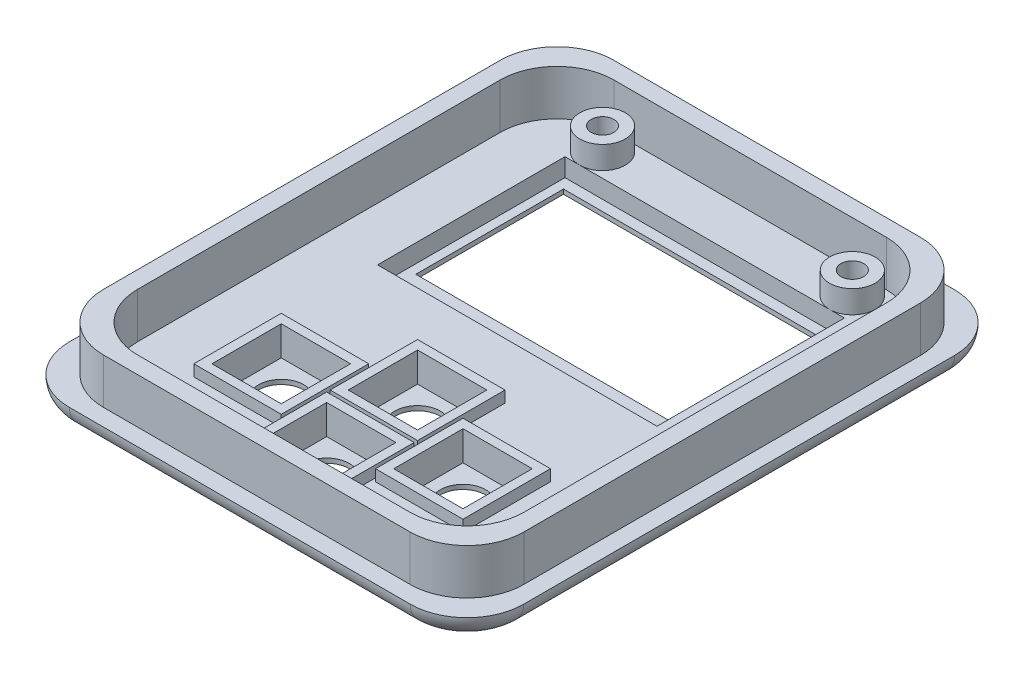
ISO-10303-21;
HEADER;
FILE_DESCRIPTION(('STEP AP214'),'2;1');
FILE_NAME('part.step','',(''),(''),'','','');
FILE_SCHEMA(('AUTOMOTIVE_DESIGN { 1 0 10303 214 1 1 1 1 }'));
ENDSEC;
DATA;
#1=APPLICATION_CONTEXT('core data for automotive mechanical design processes');
#2=APPLICATION_PROTOCOL_DEFINITION('international standard','automotive_design',2000,#1);
#3=PRODUCT_CONTEXT('',#1,'mechanical');
#4=PRODUCT('Part','Part','',(#3));
#5=PRODUCT_RELATED_PRODUCT_CATEGORY('part','',(#4));
#6=PRODUCT_DEFINITION_FORMATION('','',#4);
#7=PRODUCT_DEFINITION_CONTEXT('part definition',#1,'design');
#8=PRODUCT_DEFINITION('design','',#6,#7);
#9=PRODUCT_DEFINITION_SHAPE('','',#8);
#10=(LENGTH_UNIT() NAMED_UNIT(*) SI_UNIT(.MILLI.,.METRE.));
#11=(NAMED_UNIT(*) PLANE_ANGLE_UNIT() SI_UNIT($,.RADIAN.));
#12=(NAMED_UNIT(*) SI_UNIT($,.STERADIAN.) SOLID_ANGLE_UNIT());
#13=UNCERTAINTY_MEASURE_WITH_UNIT(LENGTH_MEASURE(1.E-05),#10,'distance_accuracy_value','');
#14=(GEOMETRIC_REPRESENTATION_CONTEXT(3) GLOBAL_UNCERTAINTY_ASSIGNED_CONTEXT((#13)) GLOBAL_UNIT_ASSIGNED_CONTEXT((#10,
#11,#12)) REPRESENTATION_CONTEXT('',''));
#15=CARTESIAN_POINT('',(0.,0.,0.));
#16=DIRECTION('',(0.,0.,1.));
#17=DIRECTION('',(1.,0.,0.));
#18=AXIS2_PLACEMENT_3D('',#15,#16,#17);
#19=CARTESIAN_POINT('',(10.995,4.,-18.965));
#20=DIRECTION('',(0.,1.,0.));
#21=DIRECTION('',(0.,0.,1.));
#22=AXIS2_PLACEMENT_3D('',#19,#20,#21);
#23=PLANE('',#22);
#24=CARTESIAN_POINT('',(10.995,4.,-18.965));
#25=DIRECTION('',(0.,1.,0.));
#26=DIRECTION('',(0.,0.,1.));
#27=AXIS2_PLACEMENT_3D('',#24,#25,#26);
#28=CIRCLE('',#27,2.0000000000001);
#29=CARTESIAN_POINT('',(10.995,4.,-16.9649999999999));
#30=VERTEX_POINT('',#29);
#31=EDGE_CURVE('E195',#30,#30,#28,.T.);
#32=ORIENTED_EDGE('',*,*,#31,.T.);
#33=EDGE_LOOP('',(#32));
#34=FACE_BOUND('',#33,.T.);
#35=CARTESIAN_POINT('',(10.995,4.,-18.965));
#36=DIRECTION('',(0.,1.,0.));
#37=DIRECTION('',(0.,0.,1.));
#38=AXIS2_PLACEMENT_3D('',#35,#36,#37);
#39=CIRCLE('',#38,1.00000000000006);
#40=CARTESIAN_POINT('',(10.995,4.,-17.9649999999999));
#41=VERTEX_POINT('',#40);
#42=EDGE_CURVE('E186',#41,#41,#39,.T.);
#43=ORIENTED_EDGE('',*,*,#42,.F.);
#44=EDGE_LOOP('',(#43));
#45=FACE_BOUND('',#44,.T.);
#46=ADVANCED_FACE('F182',(#34,#45),#23,.T.);
#47=CARTESIAN_POINT('',(10.995,0.,-18.965));
#48=DIRECTION('',(0.,1.,0.));
#49=DIRECTION('',(0.,0.,1.));
#50=AXIS2_PLACEMENT_3D('',#47,#48,#49);
#51=PLANE('',#50);
#52=CARTESIAN_POINT('',(10.995,0.,-18.965));
#53=DIRECTION('',(0.,1.,0.));
#54=DIRECTION('',(0.,0.,1.));
#55=AXIS2_PLACEMENT_3D('',#52,#53,#54);
#56=CIRCLE('',#55,2.0000000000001);
#57=CARTESIAN_POINT('',(10.995,0.,-16.9649999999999));
#58=VERTEX_POINT('',#57);
#59=EDGE_CURVE('E193',#58,#58,#56,.T.);
#60=ORIENTED_EDGE('',*,*,#59,.F.);
#61=EDGE_LOOP('',(#60));
#62=FACE_BOUND('',#61,.T.);
#63=CARTESIAN_POINT('',(10.995,0.,-18.965));
#64=DIRECTION('',(0.,1.,0.));
#65=DIRECTION('',(0.,0.,1.));
#66=AXIS2_PLACEMENT_3D('',#63,#64,#65);
#67=CIRCLE('',#66,1.00000000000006);
#68=CARTESIAN_POINT('',(10.995,0.,-17.9649999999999));
#69=VERTEX_POINT('',#68);
#70=EDGE_CURVE('E12',#69,#69,#67,.T.);
#71=ORIENTED_EDGE('',*,*,#70,.T.);
#72=EDGE_LOOP('',(#71));
#73=FACE_BOUND('',#72,.T.);
#74=ADVANCED_FACE('F203',(#62,#73),#51,.F.);
#75=CARTESIAN_POINT('',(10.995,4.,-18.965));
#76=DIRECTION('',(0.,-1.,0.));
#77=DIRECTION('',(0.,0.,-1.));
#78=AXIS2_PLACEMENT_3D('',#75,#76,#77);
#79=CYLINDRICAL_SURFACE('',#78,2.0000000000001);
#80=ORIENTED_EDGE('',*,*,#31,.F.);
#81=EDGE_LOOP('',(#80));
#82=FACE_BOUND('',#81,.T.);
#83=ORIENTED_EDGE('',*,*,#59,.T.);
#84=EDGE_LOOP('',(#83));
#85=FACE_BOUND('',#84,.T.);
#86=ADVANCED_FACE('F201',(#82,#85),#79,.T.);
#87=CARTESIAN_POINT('',(10.995,4.,-18.965));
#88=DIRECTION('',(0.,-1.,0.));
#89=DIRECTION('',(0.,0.,-1.));
#90=AXIS2_PLACEMENT_3D('',#87,#88,#89);
#91=CYLINDRICAL_SURFACE('',#90,1.00000000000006);
#92=ORIENTED_EDGE('',*,*,#42,.T.);
#93=EDGE_LOOP('',(#92));
#94=FACE_BOUND('',#93,.T.);
#95=ORIENTED_EDGE('',*,*,#70,.F.);
#96=EDGE_LOOP('',(#95));
#97=FACE_BOUND('',#96,.T.);
#98=ADVANCED_FACE('F184',(#94,#97),#91,.F.);
#99=CLOSED_SHELL('',(#46,#74,#86,#98));
#100=MANIFOLD_SOLID_BREP('B2',#99);
#101=CARTESIAN_POINT('',(-10.995,4.,-18.965));
#102=DIRECTION('',(0.,1.,0.));
#103=DIRECTION('',(0.,0.,1.));
#104=AXIS2_PLACEMENT_3D('',#101,#102,#103);
#105=PLANE('',#104);
#106=CARTESIAN_POINT('',(-10.995,4.,-18.965));
#107=DIRECTION('',(0.,1.,0.));
#108=DIRECTION('',(0.,0.,1.));
#109=AXIS2_PLACEMENT_3D('',#106,#107,#108);
#110=CIRCLE('',#109,2.0000000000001);
#111=CARTESIAN_POINT('',(-10.995,4.,-16.9649999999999));
#112=VERTEX_POINT('',#111);
#113=EDGE_CURVE('E181',#112,#112,#110,.T.);
#114=ORIENTED_EDGE('',*,*,#113,.T.);
#115=EDGE_LOOP('',(#114));
#116=FACE_BOUND('',#115,.T.);
#117=CARTESIAN_POINT('',(-10.995,4.,-18.965));
#118=DIRECTION('',(0.,1.,0.));
#119=DIRECTION('',(0.,0.,1.));
#120=AXIS2_PLACEMENT_3D('',#117,#118,#119);
#121=CIRCLE('',#120,0.995847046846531);
#122=CARTESIAN_POINT('',(-10.995,4.,-17.9691529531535));
#123=VERTEX_POINT('',#122);
#124=EDGE_CURVE('E272',#123,#123,#121,.T.);
#125=ORIENTED_EDGE('',*,*,#124,.F.);
#126=EDGE_LOOP('',(#125));
#127=FACE_BOUND('',#126,.T.);
#128=ADVANCED_FACE('F261',(#116,#127),#105,.T.);
#129=CARTESIAN_POINT('',(-10.995,0.,-18.965));
#130=DIRECTION('',(0.,1.,0.));
#131=DIRECTION('',(0.,0.,1.));
#132=AXIS2_PLACEMENT_3D('',#129,#130,#131);
#133=PLANE('',#132);
#134=CARTESIAN_POINT('',(-10.995,0.,-18.965));
#135=DIRECTION('',(0.,1.,0.));
#136=DIRECTION('',(0.,0.,1.));
#137=AXIS2_PLACEMENT_3D('',#134,#135,#136);
#138=CIRCLE('',#137,2.0000000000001);
#139=CARTESIAN_POINT('',(-10.995,0.,-16.9649999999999));
#140=VERTEX_POINT('',#139);
#141=EDGE_CURVE('E265',#140,#140,#138,.T.);
#142=ORIENTED_EDGE('',*,*,#141,.F.);
#143=EDGE_LOOP('',(#142));
#144=FACE_BOUND('',#143,.T.);
#145=CARTESIAN_POINT('',(-10.995,0.,-18.965));
#146=DIRECTION('',(0.,1.,0.));
#147=DIRECTION('',(0.,0.,1.));
#148=AXIS2_PLACEMENT_3D('',#145,#146,#147);
#149=CIRCLE('',#148,0.995847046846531);
#150=CARTESIAN_POINT('',(-10.995,0.,-17.9691529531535));
#151=VERTEX_POINT('',#150);
#152=EDGE_CURVE('E274',#151,#151,#149,.T.);
#153=ORIENTED_EDGE('',*,*,#152,.T.);
#154=EDGE_LOOP('',(#153));
#155=FACE_BOUND('',#154,.T.);
#156=ADVANCED_FACE('F284',(#144,#155),#133,.F.);
#157=CARTESIAN_POINT('',(-10.995,4.,-18.965));
#158=DIRECTION('',(0.,-1.,0.));
#159=DIRECTION('',(0.,0.,-1.));
#160=AXIS2_PLACEMENT_3D('',#157,#158,#159);
#161=CYLINDRICAL_SURFACE('',#160,2.0000000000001);
#162=ORIENTED_EDGE('',*,*,#113,.F.);
#163=EDGE_LOOP('',(#162));
#164=FACE_BOUND('',#163,.T.);
#165=ORIENTED_EDGE('',*,*,#141,.T.);
#166=EDGE_LOOP('',(#165));
#167=FACE_BOUND('',#166,.T.);
#168=ADVANCED_FACE('F263',(#164,#167),#161,.T.);
#169=CARTESIAN_POINT('',(-10.995,4.,-18.965));
#170=DIRECTION('',(0.,-1.,0.));
#171=DIRECTION('',(0.,0.,-1.));
#172=AXIS2_PLACEMENT_3D('',#169,#170,#171);
#173=CYLINDRICAL_SURFACE('',#172,0.995847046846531);
#174=ORIENTED_EDGE('',*,*,#124,.T.);
#175=EDGE_LOOP('',(#174));
#176=FACE_BOUND('',#175,.T.);
#177=ORIENTED_EDGE('',*,*,#152,.F.);
#178=EDGE_LOOP('',(#177));
#179=FACE_BOUND('',#178,.T.);
#180=ADVANCED_FACE('F280',(#176,#179),#173,.F.);
#181=CLOSED_SHELL('',(#128,#156,#168,#180));
#182=MANIFOLD_SOLID_BREP('B7',#181);
#183=CARTESIAN_POINT('',(0.,2.,0.));
#184=DIRECTION('',(0.,1.,0.));
#185=DIRECTION('',(0.,0.,1.));
#186=AXIS2_PLACEMENT_3D('',#183,#184,#185);
#187=PLANE('',#186);
#188=DIRECTION('',(-1.,0.,0.));
#189=VECTOR('',#188,1.);
#190=CARTESIAN_POINT('',(0.,2.,12.4648312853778));
#191=LINE('',#190,#189);
#192=CARTESIAN_POINT('',(3.85,2.,12.4648312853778));
#193=VERTEX_POINT('',#192);
#194=CARTESIAN_POINT('',(-3.85,2.,12.4648312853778));
#195=VERTEX_POINT('',#194);
#196=EDGE_CURVE('E766',#193,#195,#191,.T.);
#197=ORIENTED_EDGE('',*,*,#196,.F.);
#198=DIRECTION('',(0.,0.,-1.));
#199=VECTOR('',#198,1.);
#200=CARTESIAN_POINT('',(3.85,2.,0.));
#201=LINE('',#200,#199);
#202=CARTESIAN_POINT('',(3.85,2.,20.1648312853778));
#203=VERTEX_POINT('',#202);
#204=EDGE_CURVE('E758',#203,#193,#201,.T.);
#205=ORIENTED_EDGE('',*,*,#204,.F.);
#206=DIRECTION('',(-1.,0.,0.));
#207=VECTOR('',#206,1.);
#208=CARTESIAN_POINT('',(0.,2.,20.1648312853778));
#209=LINE('',#208,#207);
#210=CARTESIAN_POINT('',(-3.85,2.,20.1648312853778));
#211=VERTEX_POINT('',#210);
#212=EDGE_CURVE('E353',#203,#211,#209,.T.);
#213=ORIENTED_EDGE('',*,*,#212,.T.);
#214=DIRECTION('',(0.,0.,-1.));
#215=VECTOR('',#214,1.);
#216=CARTESIAN_POINT('',(-3.85,2.,0.));
#217=LINE('',#216,#215);
#218=EDGE_CURVE('E348',#211,#195,#217,.T.);
#219=ORIENTED_EDGE('',*,*,#218,.T.);
#220=EDGE_LOOP('',(#197,#205,#213,#219));
#221=FACE_BOUND('',#220,.T.);
#222=DIRECTION('',(0.,0.,-1.));
#223=VECTOR('',#222,1.);
#224=CARTESIAN_POINT('',(-11.85,2.,0.));
#225=LINE('',#224,#223);
#226=CARTESIAN_POINT('',(-11.85,2.,16.1648312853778));
#227=VERTEX_POINT('',#226);
#228=CARTESIAN_POINT('',(-11.85,2.,8.46483128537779));
#229=VERTEX_POINT('',#228);
#230=EDGE_CURVE('E898',#227,#229,#225,.T.);
#231=ORIENTED_EDGE('',*,*,#230,.T.);
#232=DIRECTION('',(1.,0.,0.));
#233=VECTOR('',#232,1.);
#234=CARTESIAN_POINT('',(0.,2.,8.46483128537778));
#235=LINE('',#234,#233);
#236=CARTESIAN_POINT('',(-4.15,2.,8.46483128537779));
#237=VERTEX_POINT('',#236);
#238=EDGE_CURVE('E900',#229,#237,#235,.T.);
#239=ORIENTED_EDGE('',*,*,#238,.T.);
#240=DIRECTION('',(0.,0.,-1.));
#241=VECTOR('',#240,1.);
#242=CARTESIAN_POINT('',(-4.15,2.,0.));
#243=LINE('',#242,#241);
#244=CARTESIAN_POINT('',(-4.15,2.,16.1648312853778));
#245=VERTEX_POINT('',#244);
#246=EDGE_CURVE('E892',#245,#237,#243,.T.);
#247=ORIENTED_EDGE('',*,*,#246,.F.);
#248=DIRECTION('',(1.,0.,0.));
#249=VECTOR('',#248,1.);
#250=CARTESIAN_POINT('',(0.,2.,16.1648312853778));
#251=LINE('',#250,#249);
#252=EDGE_CURVE('E895',#227,#245,#251,.T.);
#253=ORIENTED_EDGE('',*,*,#252,.F.);
#254=EDGE_LOOP('',(#231,#239,#247,#253));
#255=FACE_BOUND('',#254,.T.);
#256=DIRECTION('',(-1.,0.,0.));
#257=VECTOR('',#256,1.);
#258=CARTESIAN_POINT('',(0.,2.,-20.965));
#259=LINE('',#258,#257);
#260=CARTESIAN_POINT('',(12.,2.,-20.965));
#261=VERTEX_POINT('',#260);
#262=CARTESIAN_POINT('',(-12.,2.,-20.965));
#263=VERTEX_POINT('',#262);
#264=EDGE_CURVE('E1078',#261,#263,#259,.T.);
#265=ORIENTED_EDGE('',*,*,#264,.T.);
#266=CARTESIAN_POINT('',(-12.,2.,-15.965));
#267=DIRECTION('',(0.,1.,0.));
#268=DIRECTION('',(0.,0.,1.));
#269=AXIS2_PLACEMENT_3D('',#266,#267,#268);
#270=CIRCLE('',#269,5.);
#271=CARTESIAN_POINT('',(-17.,2.,-15.965));
#272=VERTEX_POINT('',#271);
#273=EDGE_CURVE('E1114',#263,#272,#270,.T.);
#274=ORIENTED_EDGE('',*,*,#273,.T.);
#275=DIRECTION('',(0.,0.,-1.));
#276=VECTOR('',#275,1.);
#277=CARTESIAN_POINT('',(-17.,2.,0.));
#278=LINE('',#277,#276);
#279=CARTESIAN_POINT('',(-17.,2.,15.965));
#280=VERTEX_POINT('',#279);
#281=EDGE_CURVE('E1075',#280,#272,#278,.T.);
#282=ORIENTED_EDGE('',*,*,#281,.F.);
#283=CARTESIAN_POINT('',(-12.,2.,15.965));
#284=DIRECTION('',(0.,1.,0.));
#285=DIRECTION('',(0.,0.,1.));
#286=AXIS2_PLACEMENT_3D('',#283,#284,#285);
#287=CIRCLE('',#286,5.);
#288=CARTESIAN_POINT('',(-12.,2.,20.965));
#289=VERTEX_POINT('',#288);
#290=EDGE_CURVE('E1108',#280,#289,#287,.T.);
#291=ORIENTED_EDGE('',*,*,#290,.T.);
#292=DIRECTION('',(-1.,0.,0.));
#293=VECTOR('',#292,1.);
#294=CARTESIAN_POINT('',(0.,2.,20.965));
#295=LINE('',#294,#293);
#296=CARTESIAN_POINT('',(12.,2.,20.965));
#297=VERTEX_POINT('',#296);
#298=EDGE_CURVE('E1072',#297,#289,#295,.T.);
#299=ORIENTED_EDGE('',*,*,#298,.F.);
#300=CARTESIAN_POINT('',(12.,2.,15.965));
#301=DIRECTION('',(0.,1.,0.));
#302=DIRECTION('',(0.,0.,1.));
#303=AXIS2_PLACEMENT_3D('',#300,#301,#302);
#304=CIRCLE('',#303,5.);
#305=CARTESIAN_POINT('',(17.,2.,15.965));
#306=VERTEX_POINT('',#305);
#307=EDGE_CURVE('E1110',#297,#306,#304,.T.);
#308=ORIENTED_EDGE('',*,*,#307,.T.);
#309=DIRECTION('',(0.,0.,-1.));
#310=VECTOR('',#309,1.);
#311=CARTESIAN_POINT('',(17.,2.,0.));
#312=LINE('',#311,#310);
#313=CARTESIAN_POINT('',(17.,2.,-15.965));
#314=VERTEX_POINT('',#313);
#315=EDGE_CURVE('E1069',#306,#314,#312,.T.);
#316=ORIENTED_EDGE('',*,*,#315,.T.);
#317=CARTESIAN_POINT('',(12.,2.,-15.965));
#318=DIRECTION('',(0.,1.,0.));
#319=DIRECTION('',(0.,0.,1.));
#320=AXIS2_PLACEMENT_3D('',#317,#318,#319);
#321=CIRCLE('',#320,5.);
#322=EDGE_CURVE('E1112',#314,#261,#321,.T.);
#323=ORIENTED_EDGE('',*,*,#322,.T.);
#324=EDGE_LOOP('',(#265,#274,#282,#291,#299,#308,#316,#323));
#325=FACE_BOUND('',#324,.T.);
#326=CARTESIAN_POINT('',(10.995,2.,-18.965));
#327=DIRECTION('',(0.,1.,0.));
#328=DIRECTION('',(0.,0.,1.));
#329=AXIS2_PLACEMENT_3D('',#326,#327,#328);
#330=CIRCLE('',#329,1.00000000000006);
#331=CARTESIAN_POINT('',(10.995,2.,-17.9649999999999));
#332=VERTEX_POINT('',#331);
#333=EDGE_CURVE('E1009',#332,#332,#330,.F.);
#334=ORIENTED_EDGE('',*,*,#333,.T.);
#335=EDGE_LOOP('',(#334));
#336=FACE_BOUND('',#335,.T.);
#337=CARTESIAN_POINT('',(-10.995,2.,-18.965));
#338=DIRECTION('',(0.,1.,0.));
#339=DIRECTION('',(0.,0.,1.));
#340=AXIS2_PLACEMENT_3D('',#337,#338,#339);
#341=CIRCLE('',#340,0.995847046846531);
#342=CARTESIAN_POINT('',(-10.995,2.,-17.9691529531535));
#343=VERTEX_POINT('',#342);
#344=EDGE_CURVE('E1039',#343,#343,#341,.F.);
#345=ORIENTED_EDGE('',*,*,#344,.T.);
#346=EDGE_LOOP('',(#345));
#347=FACE_BOUND('',#346,.T.);
#348=DIRECTION('',(-1.,0.,0.));
#349=VECTOR('',#348,1.);
#350=CARTESIAN_POINT('',(0.,2.,-16.965));
#351=LINE('',#350,#349);
#352=CARTESIAN_POINT('',(12.3,2.,-16.965));
#353=VERTEX_POINT('',#352);
#354=CARTESIAN_POINT('',(-12.3,2.,-16.965));
#355=VERTEX_POINT('',#354);
#356=EDGE_CURVE('E259',#353,#355,#351,.T.);
#357=ORIENTED_EDGE('',*,*,#356,.F.);
#358=DIRECTION('',(0.,0.,-1.));
#359=VECTOR('',#358,1.);
#360=CARTESIAN_POINT('',(12.3,2.,0.));
#361=LINE('',#360,#359);
#362=CARTESIAN_POINT('',(12.3,2.,-0.464999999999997));
#363=VERTEX_POINT('',#362);
#364=EDGE_CURVE('E1224',#363,#353,#361,.T.);
#365=ORIENTED_EDGE('',*,*,#364,.F.);
#366=DIRECTION('',(-1.,0.,0.));
#367=VECTOR('',#366,1.);
#368=CARTESIAN_POINT('',(0.,2.,-0.464999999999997));
#369=LINE('',#368,#367);
#370=CARTESIAN_POINT('',(-12.3,2.,-0.464999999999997));
#371=VERTEX_POINT('',#370);
#372=EDGE_CURVE('E1230',#363,#371,#369,.T.);
#373=ORIENTED_EDGE('',*,*,#372,.T.);
#374=DIRECTION('',(0.,0.,-1.));
#375=VECTOR('',#374,1.);
#376=CARTESIAN_POINT('',(-12.3,2.,0.));
#377=LINE('',#376,#375);
#378=EDGE_CURVE('E340',#371,#355,#377,.T.);
#379=ORIENTED_EDGE('',*,*,#378,.T.);
#380=EDGE_LOOP('',(#357,#365,#373,#379));
#381=FACE_BOUND('',#380,.T.);
#382=DIRECTION('',(-1.,0.,0.));
#383=VECTOR('',#382,1.);
#384=CARTESIAN_POINT('',(0.,2.,4.46483128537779));
#385=LINE('',#384,#383);
#386=CARTESIAN_POINT('',(3.85,2.,4.46483128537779));
#387=VERTEX_POINT('',#386);
#388=CARTESIAN_POINT('',(-3.85,2.,4.46483128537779));
#389=VERTEX_POINT('',#388);
#390=EDGE_CURVE('E854',#387,#389,#385,.T.);
#391=ORIENTED_EDGE('',*,*,#390,.F.);
#392=DIRECTION('',(0.,0.,-1.));
#393=VECTOR('',#392,1.);
#394=CARTESIAN_POINT('',(3.85,2.,0.));
#395=LINE('',#394,#393);
#396=CARTESIAN_POINT('',(3.85,2.,12.1648312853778));
#397=VERTEX_POINT('',#396);
#398=EDGE_CURVE('E847',#397,#387,#395,.T.);
#399=ORIENTED_EDGE('',*,*,#398,.F.);
#400=DIRECTION('',(-1.,0.,0.));
#401=VECTOR('',#400,1.);
#402=CARTESIAN_POINT('',(0.,2.,12.1648312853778));
#403=LINE('',#402,#401);
#404=CARTESIAN_POINT('',(-3.85,2.,12.1648312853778));
#405=VERTEX_POINT('',#404);
#406=EDGE_CURVE('E850',#397,#405,#403,.T.);
#407=ORIENTED_EDGE('',*,*,#406,.T.);
#408=DIRECTION('',(0.,0.,-1.));
#409=VECTOR('',#408,1.);
#410=CARTESIAN_POINT('',(-3.85,2.,0.));
#411=LINE('',#410,#409);
#412=EDGE_CURVE('E852',#405,#389,#411,.T.);
#413=ORIENTED_EDGE('',*,*,#412,.T.);
#414=EDGE_LOOP('',(#391,#399,#407,#413));
#415=FACE_BOUND('',#414,.T.);
#416=DIRECTION('',(0.,0.,-1.));
#417=VECTOR('',#416,1.);
#418=CARTESIAN_POINT('',(4.15,2.,0.));
#419=LINE('',#418,#417);
#420=CARTESIAN_POINT('',(4.15,2.,16.1648312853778));
#421=VERTEX_POINT('',#420);
#422=CARTESIAN_POINT('',(4.15,2.,8.46483128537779));
#423=VERTEX_POINT('',#422);
#424=EDGE_CURVE('E809',#421,#423,#419,.T.);
#425=ORIENTED_EDGE('',*,*,#424,.T.);
#426=DIRECTION('',(1.,0.,0.));
#427=VECTOR('',#426,1.);
#428=CARTESIAN_POINT('',(0.,2.,8.46483128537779));
#429=LINE('',#428,#427);
#430=CARTESIAN_POINT('',(11.85,2.,8.46483128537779));
#431=VERTEX_POINT('',#430);
#432=EDGE_CURVE('E811',#423,#431,#429,.T.);
#433=ORIENTED_EDGE('',*,*,#432,.T.);
#434=DIRECTION('',(0.,0.,-1.));
#435=VECTOR('',#434,1.);
#436=CARTESIAN_POINT('',(11.85,2.,0.));
#437=LINE('',#436,#435);
#438=CARTESIAN_POINT('',(11.85,2.,16.1648312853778));
#439=VERTEX_POINT('',#438);
#440=EDGE_CURVE('E803',#439,#431,#437,.T.);
#441=ORIENTED_EDGE('',*,*,#440,.F.);
#442=DIRECTION('',(1.,0.,0.));
#443=VECTOR('',#442,1.);
#444=CARTESIAN_POINT('',(0.,2.,16.1648312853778));
#445=LINE('',#444,#443);
#446=EDGE_CURVE('E806',#421,#439,#445,.T.);
#447=ORIENTED_EDGE('',*,*,#446,.F.);
#448=EDGE_LOOP('',(#425,#433,#441,#447));
#449=FACE_BOUND('',#448,.T.);
#450=ADVANCED_FACE('F331',(#221,#255,#325,#336,#347,#381,#415,#449),#187,.T.);
#451=CARTESIAN_POINT('',(-8.,6.,12.3148312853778));
#452=DIRECTION('',(0.,-1.,0.));
#453=DIRECTION('',(0.,0.,-1.));
#454=AXIS2_PLACEMENT_3D('',#451,#452,#453);
#455=CYLINDRICAL_SURFACE('',#454,2.);
#456=CARTESIAN_POINT('',(-8.,0.,12.3148312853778));
#457=DIRECTION('',(0.,1.,0.));
#458=DIRECTION('',(0.,0.,1.));
#459=AXIS2_PLACEMENT_3D('',#456,#457,#458);
#460=CIRCLE('',#459,2.);
#461=CARTESIAN_POINT('',(-8.,0.,14.3148312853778));
#462=VERTEX_POINT('',#461);
#463=EDGE_CURVE('E1035',#462,#462,#460,.T.);
#464=ORIENTED_EDGE('',*,*,#463,.F.);
#465=EDGE_LOOP('',(#464));
#466=FACE_BOUND('',#465,.T.);
#467=CARTESIAN_POINT('',(-8.,0.4,12.3148312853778));
#468=DIRECTION('',(0.,1.,0.));
#469=DIRECTION('',(0.,0.,1.));
#470=AXIS2_PLACEMENT_3D('',#467,#468,#469);
#471=CIRCLE('',#470,2.);
#472=CARTESIAN_POINT('',(-8.,0.4,14.3148312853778));
#473=VERTEX_POINT('',#472);
#474=EDGE_CURVE('E1239',#473,#473,#471,.T.);
#475=ORIENTED_EDGE('',*,*,#474,.T.);
#476=EDGE_LOOP('',(#475));
#477=FACE_BOUND('',#476,.T.);
#478=ADVANCED_FACE('F1280',(#466,#477),#455,.F.);
#479=CARTESIAN_POINT('',(8.,6.,12.3148312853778));
#480=DIRECTION('',(0.,-1.,0.));
#481=DIRECTION('',(0.,0.,-1.));
#482=AXIS2_PLACEMENT_3D('',#479,#480,#481);
#483=CYLINDRICAL_SURFACE('',#482,2.);
#484=CARTESIAN_POINT('',(8.,0.,12.3148312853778));
#485=DIRECTION('',(0.,1.,0.));
#486=DIRECTION('',(0.,0.,1.));
#487=AXIS2_PLACEMENT_3D('',#484,#485,#486);
#488=CIRCLE('',#487,2.);
#489=CARTESIAN_POINT('',(8.,0.,14.3148312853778));
#490=VERTEX_POINT('',#489);
#491=EDGE_CURVE('E1032',#490,#490,#488,.T.);
#492=ORIENTED_EDGE('',*,*,#491,.F.);
#493=EDGE_LOOP('',(#492));
#494=FACE_BOUND('',#493,.T.);
#495=CARTESIAN_POINT('',(8.,0.4,12.3148312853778));
#496=DIRECTION('',(0.,1.,0.));
#497=DIRECTION('',(0.,0.,1.));
#498=AXIS2_PLACEMENT_3D('',#495,#496,#497);
#499=CIRCLE('',#498,2.);
#500=CARTESIAN_POINT('',(8.,0.4,14.3148312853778));
#501=VERTEX_POINT('',#500);
#502=EDGE_CURVE('E1237',#501,#501,#499,.T.);
#503=ORIENTED_EDGE('',*,*,#502,.T.);
#504=EDGE_LOOP('',(#503));
#505=FACE_BOUND('',#504,.T.);
#506=ADVANCED_FACE('F1261',(#494,#505),#483,.F.);
#507=CARTESIAN_POINT('',(0.,0.,0.));
#508=DIRECTION('',(0.,1.,0.));
#509=DIRECTION('',(0.,0.,1.));
#510=AXIS2_PLACEMENT_3D('',#507,#508,#509);
#511=PLANE('',#510);
#512=ORIENTED_EDGE('',*,*,#491,.T.);
#513=EDGE_LOOP('',(#512));
#514=FACE_BOUND('',#513,.T.);
#515=ORIENTED_EDGE('',*,*,#463,.T.);
#516=EDGE_LOOP('',(#515));
#517=FACE_BOUND('',#516,.T.);
#518=DIRECTION('',(1.,0.,0.));
#519=VECTOR('',#518,1.);
#520=CARTESIAN_POINT('',(15.,0.,-21.965));
#521=LINE('',#520,#519);
#522=CARTESIAN_POINT('',(-15.,0.,-21.965));
#523=VERTEX_POINT('',#522);
#524=CARTESIAN_POINT('',(15.,0.,-21.965));
#525=VERTEX_POINT('',#524);
#526=EDGE_CURVE('E1196',#523,#525,#521,.T.);
#527=ORIENTED_EDGE('',*,*,#526,.T.);
#528=CARTESIAN_POINT('',(15.,0.,-18.965));
#529=DIRECTION('',(0.,1.,0.));
#530=DIRECTION('',(0.,0.,1.));
#531=AXIS2_PLACEMENT_3D('',#528,#529,#530);
#532=CIRCLE('',#531,3.);
#533=CARTESIAN_POINT('',(18.,0.,-18.965));
#534=VERTEX_POINT('',#533);
#535=EDGE_CURVE('E1198',#525,#534,#532,.F.);
#536=ORIENTED_EDGE('',*,*,#535,.T.);
#537=DIRECTION('',(0.,0.,1.));
#538=VECTOR('',#537,1.);
#539=CARTESIAN_POINT('',(18.,0.,18.965));
#540=LINE('',#539,#538);
#541=CARTESIAN_POINT('',(18.,0.,18.965));
#542=VERTEX_POINT('',#541);
#543=EDGE_CURVE('E1184',#534,#542,#540,.T.);
#544=ORIENTED_EDGE('',*,*,#543,.T.);
#545=CARTESIAN_POINT('',(15.,0.,18.965));
#546=DIRECTION('',(0.,1.,0.));
#547=DIRECTION('',(0.,0.,1.));
#548=AXIS2_PLACEMENT_3D('',#545,#546,#547);
#549=CIRCLE('',#548,3.);
#550=CARTESIAN_POINT('',(15.,0.,21.965));
#551=VERTEX_POINT('',#550);
#552=EDGE_CURVE('E1186',#542,#551,#549,.F.);
#553=ORIENTED_EDGE('',*,*,#552,.T.);
#554=DIRECTION('',(1.,0.,0.));
#555=VECTOR('',#554,1.);
#556=CARTESIAN_POINT('',(0.,0.,21.965));
#557=LINE('',#556,#555);
#558=CARTESIAN_POINT('',(-15.,0.,21.965));
#559=VERTEX_POINT('',#558);
#560=EDGE_CURVE('E1188',#551,#559,#557,.F.);
#561=ORIENTED_EDGE('',*,*,#560,.T.);
#562=CARTESIAN_POINT('',(-15.,0.,18.965));
#563=DIRECTION('',(0.,1.,0.));
#564=DIRECTION('',(0.,0.,1.));
#565=AXIS2_PLACEMENT_3D('',#562,#563,#564);
#566=CIRCLE('',#565,3.);
#567=CARTESIAN_POINT('',(-18.,0.,18.965));
#568=VERTEX_POINT('',#567);
#569=EDGE_CURVE('E1190',#559,#568,#566,.F.);
#570=ORIENTED_EDGE('',*,*,#569,.T.);
#571=DIRECTION('',(0.,0.,1.));
#572=VECTOR('',#571,1.);
#573=CARTESIAN_POINT('',(-18.,0.,0.));
#574=LINE('',#573,#572);
#575=CARTESIAN_POINT('',(-18.,0.,-18.965));
#576=VERTEX_POINT('',#575);
#577=EDGE_CURVE('E1192',#568,#576,#574,.F.);
#578=ORIENTED_EDGE('',*,*,#577,.T.);
#579=CARTESIAN_POINT('',(-15.,0.,-18.965));
#580=DIRECTION('',(0.,1.,0.));
#581=DIRECTION('',(0.,0.,1.));
#582=AXIS2_PLACEMENT_3D('',#579,#580,#581);
#583=CIRCLE('',#582,3.);
#584=EDGE_CURVE('E1194',#576,#523,#583,.F.);
#585=ORIENTED_EDGE('',*,*,#584,.T.);
#586=EDGE_LOOP('',(#527,#536,#544,#553,#561,#570,#578,#585));
#587=FACE_BOUND('',#586,.T.);
#588=DIRECTION('',(0.,0.,1.));
#589=VECTOR('',#588,1.);
#590=CARTESIAN_POINT('',(11.5,0.,-16.03233694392));
#591=LINE('',#590,#589);
#592=CARTESIAN_POINT('',(11.5,0.,-16.03233694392));
#593=VERTEX_POINT('',#592);
#594=CARTESIAN_POINT('',(11.5,0.,-3.03233694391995));
#595=VERTEX_POINT('',#594);
#596=EDGE_CURVE('E1013',#593,#595,#591,.T.);
#597=ORIENTED_EDGE('',*,*,#596,.F.);
#598=DIRECTION('',(1.,0.,0.));
#599=VECTOR('',#598,1.);
#600=CARTESIAN_POINT('',(-11.5,0.,-16.03233694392));
#601=LINE('',#600,#599);
#602=CARTESIAN_POINT('',(-11.5,0.,-16.03233694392));
#603=VERTEX_POINT('',#602);
#604=EDGE_CURVE('E1010',#603,#593,#601,.T.);
#605=ORIENTED_EDGE('',*,*,#604,.F.);
#606=DIRECTION('',(0.,0.,1.));
#607=VECTOR('',#606,1.);
#608=CARTESIAN_POINT('',(-11.5,0.,-16.03233694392));
#609=LINE('',#608,#607);
#610=CARTESIAN_POINT('',(-11.5,0.,-3.03233694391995));
#611=VERTEX_POINT('',#610);
#612=EDGE_CURVE('E1020',#603,#611,#609,.T.);
#613=ORIENTED_EDGE('',*,*,#612,.T.);
#614=DIRECTION('',(1.,0.,0.));
#615=VECTOR('',#614,1.);
#616=CARTESIAN_POINT('',(-11.5,0.,-3.03233694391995));
#617=LINE('',#616,#615);
#618=EDGE_CURVE('E1017',#611,#595,#617,.T.);
#619=ORIENTED_EDGE('',*,*,#618,.T.);
#620=EDGE_LOOP('',(#597,#605,#613,#619));
#621=FACE_BOUND('',#620,.T.);
#622=CARTESIAN_POINT('',(0.,0.,8.31483128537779));
#623=DIRECTION('',(0.,1.,0.));
#624=DIRECTION('',(0.,0.,1.));
#625=AXIS2_PLACEMENT_3D('',#622,#623,#624);
#626=CIRCLE('',#625,2.);
#627=CARTESIAN_POINT('',(0.,0.,10.3148312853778));
#628=VERTEX_POINT('',#627);
#629=EDGE_CURVE('E1014',#628,#628,#626,.T.);
#630=ORIENTED_EDGE('',*,*,#629,.T.);
#631=EDGE_LOOP('',(#630));
#632=FACE_BOUND('',#631,.T.);
#633=CARTESIAN_POINT('',(0.,0.,16.3148312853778));
#634=DIRECTION('',(0.,1.,0.));
#635=DIRECTION('',(0.,0.,1.));
#636=AXIS2_PLACEMENT_3D('',#633,#634,#635);
#637=CIRCLE('',#636,2.);
#638=CARTESIAN_POINT('',(0.,0.,18.3148312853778));
#639=VERTEX_POINT('',#638);
#640=EDGE_CURVE('E1036',#639,#639,#637,.T.);
#641=ORIENTED_EDGE('',*,*,#640,.T.);
#642=EDGE_LOOP('',(#641));
#643=FACE_BOUND('',#642,.T.);
#644=ADVANCED_FACE('F1257',(#514,#517,#587,#621,#632,#643),#511,.F.);
#645=DIRECTION('',(-1.,0.,0.));
#646=VECTOR('',#645,1.);
#647=CARTESIAN_POINT('',(0.,2.,-22.465));
#648=LINE('',#647,#646);
#649=CARTESIAN_POINT('',(13.5,2.,-22.465));
#650=VERTEX_POINT('',#649);
#651=CARTESIAN_POINT('',(-13.5,2.,-22.465));
#652=VERTEX_POINT('',#651);
#653=EDGE_CURVE('E1090',#650,#652,#648,.T.);
#654=ORIENTED_EDGE('',*,*,#653,.F.);
#655=CARTESIAN_POINT('',(13.5,2.,-17.465));
#656=DIRECTION('',(0.,1.,0.));
#657=DIRECTION('',(0.,0.,1.));
#658=AXIS2_PLACEMENT_3D('',#655,#656,#657);
#659=CIRCLE('',#658,5.);
#660=CARTESIAN_POINT('',(18.5,2.,-17.465));
#661=VERTEX_POINT('',#660);
#662=EDGE_CURVE('E1178',#650,#661,#659,.F.);
#663=ORIENTED_EDGE('',*,*,#662,.T.);
#664=DIRECTION('',(0.,0.,-1.));
#665=VECTOR('',#664,1.);
#666=CARTESIAN_POINT('',(18.5,2.,0.));
#667=LINE('',#666,#665);
#668=CARTESIAN_POINT('',(18.5,2.,17.465));
#669=VERTEX_POINT('',#668);
#670=EDGE_CURVE('E1081',#669,#661,#667,.T.);
#671=ORIENTED_EDGE('',*,*,#670,.F.);
#672=CARTESIAN_POINT('',(13.5,2.,17.465));
#673=DIRECTION('',(0.,1.,0.));
#674=DIRECTION('',(0.,0.,1.));
#675=AXIS2_PLACEMENT_3D('',#672,#673,#674);
#676=CIRCLE('',#675,5.);
#677=CARTESIAN_POINT('',(13.5,2.,22.465));
#678=VERTEX_POINT('',#677);
#679=EDGE_CURVE('E1180',#669,#678,#676,.F.);
#680=ORIENTED_EDGE('',*,*,#679,.T.);
#681=DIRECTION('',(-1.,0.,0.));
#682=VECTOR('',#681,1.);
#683=CARTESIAN_POINT('',(0.,2.,22.465));
#684=LINE('',#683,#682);
#685=CARTESIAN_POINT('',(-13.5,2.,22.465));
#686=VERTEX_POINT('',#685);
#687=EDGE_CURVE('E1084',#678,#686,#684,.T.);
#688=ORIENTED_EDGE('',*,*,#687,.T.);
#689=CARTESIAN_POINT('',(-13.5,2.,17.465));
#690=DIRECTION('',(0.,1.,0.));
#691=DIRECTION('',(0.,0.,1.));
#692=AXIS2_PLACEMENT_3D('',#689,#690,#691);
#693=CIRCLE('',#692,5.);
#694=CARTESIAN_POINT('',(-18.5,2.,17.465));
#695=VERTEX_POINT('',#694);
#696=EDGE_CURVE('E1182',#686,#695,#693,.F.);
#697=ORIENTED_EDGE('',*,*,#696,.T.);
#698=DIRECTION('',(0.,0.,-1.));
#699=VECTOR('',#698,1.);
#700=CARTESIAN_POINT('',(-18.5,2.,0.));
#701=LINE('',#700,#699);
#702=CARTESIAN_POINT('',(-18.5,2.,-17.465));
#703=VERTEX_POINT('',#702);
#704=EDGE_CURVE('E1087',#695,#703,#701,.T.);
#705=ORIENTED_EDGE('',*,*,#704,.T.);
#706=CARTESIAN_POINT('',(-13.5,2.,-17.465));
#707=DIRECTION('',(0.,1.,0.));
#708=DIRECTION('',(0.,0.,1.));
#709=AXIS2_PLACEMENT_3D('',#706,#707,#708);
#710=CIRCLE('',#709,5.);
#711=EDGE_CURVE('E1176',#703,#652,#710,.F.);
#712=ORIENTED_EDGE('',*,*,#711,.T.);
#713=EDGE_LOOP('',(#654,#663,#671,#680,#688,#697,#705,#712));
#714=FACE_BOUND('',#713,.T.);
#715=DIRECTION('',(1.,0.,0.));
#716=VECTOR('',#715,1.);
#717=CARTESIAN_POINT('',(-20.,2.,23.965));
#718=LINE('',#717,#716);
#719=CARTESIAN_POINT('',(-15.,2.,23.965));
#720=VERTEX_POINT('',#719);
#721=CARTESIAN_POINT('',(15.,2.,23.965));
#722=VERTEX_POINT('',#721);
#723=EDGE_CURVE('E1095',#720,#722,#718,.T.);
#724=ORIENTED_EDGE('',*,*,#723,.T.);
#725=CARTESIAN_POINT('',(15.,2.,18.965));
#726=DIRECTION('',(0.,1.,0.));
#727=DIRECTION('',(0.,0.,1.));
#728=AXIS2_PLACEMENT_3D('',#725,#726,#727);
#729=CIRCLE('',#728,5.);
#730=CARTESIAN_POINT('',(20.,2.,18.965));
#731=VERTEX_POINT('',#730);
#732=EDGE_CURVE('E1166',#722,#731,#729,.T.);
#733=ORIENTED_EDGE('',*,*,#732,.T.);
#734=DIRECTION('',(0.,0.,1.));
#735=VECTOR('',#734,1.);
#736=CARTESIAN_POINT('',(20.,2.,-23.965));
#737=LINE('',#736,#735);
#738=CARTESIAN_POINT('',(20.,2.,-18.965));
#739=VERTEX_POINT('',#738);
#740=EDGE_CURVE('E1097',#739,#731,#737,.T.);
#741=ORIENTED_EDGE('',*,*,#740,.F.);
#742=CARTESIAN_POINT('',(15.,2.,-18.965));
#743=DIRECTION('',(0.,1.,0.));
#744=DIRECTION('',(0.,0.,1.));
#745=AXIS2_PLACEMENT_3D('',#742,#743,#744);
#746=CIRCLE('',#745,5.);
#747=CARTESIAN_POINT('',(15.,2.,-23.965));
#748=VERTEX_POINT('',#747);
#749=EDGE_CURVE('E1159',#739,#748,#746,.T.);
#750=ORIENTED_EDGE('',*,*,#749,.T.);
#751=DIRECTION('',(1.,0.,0.));
#752=VECTOR('',#751,1.);
#753=CARTESIAN_POINT('',(-20.,2.,-23.965));
#754=LINE('',#753,#752);
#755=CARTESIAN_POINT('',(-15.,2.,-23.965));
#756=VERTEX_POINT('',#755);
#757=EDGE_CURVE('E1100',#756,#748,#754,.T.);
#758=ORIENTED_EDGE('',*,*,#757,.F.);
#759=CARTESIAN_POINT('',(-15.,2.,-18.965));
#760=DIRECTION('',(0.,1.,0.));
#761=DIRECTION('',(0.,0.,1.));
#762=AXIS2_PLACEMENT_3D('',#759,#760,#761);
#763=CIRCLE('',#762,5.);
#764=CARTESIAN_POINT('',(-20.,2.,-18.965));
#765=VERTEX_POINT('',#764);
#766=EDGE_CURVE('E1162',#756,#765,#763,.T.);
#767=ORIENTED_EDGE('',*,*,#766,.T.);
#768=DIRECTION('',(0.,0.,1.));
#769=VECTOR('',#768,1.);
#770=CARTESIAN_POINT('',(-20.,2.,-23.965));
#771=LINE('',#770,#769);
#772=CARTESIAN_POINT('',(-20.,2.,18.965));
#773=VERTEX_POINT('',#772);
#774=EDGE_CURVE('E1093',#765,#773,#771,.T.);
#775=ORIENTED_EDGE('',*,*,#774,.T.);
#776=CARTESIAN_POINT('',(-15.,2.,18.965));
#777=DIRECTION('',(0.,1.,0.));
#778=DIRECTION('',(0.,0.,1.));
#779=AXIS2_PLACEMENT_3D('',#776,#777,#778);
#780=CIRCLE('',#779,5.);
#781=EDGE_CURVE('E1164',#773,#720,#780,.T.);
#782=ORIENTED_EDGE('',*,*,#781,.T.);
#783=EDGE_LOOP('',(#724,#733,#741,#750,#758,#767,#775,#782));
#784=FACE_BOUND('',#783,.T.);
#785=ADVANCED_FACE('F1260',(#714,#784),#187,.T.);
#786=CARTESIAN_POINT('',(-18.5,6.,-22.465));
#787=DIRECTION('',(0.,0.,-1.));
#788=DIRECTION('',(-1.,0.,0.));
#789=AXIS2_PLACEMENT_3D('',#786,#787,#788);
#790=PLANE('',#789);
#791=ORIENTED_EDGE('',*,*,#653,.T.);
#792=DIRECTION('',(0.,-1.,0.));
#793=VECTOR('',#792,1.);
#794=CARTESIAN_POINT('',(-13.5,6.,-22.465));
#795=LINE('',#794,#793);
#796=CARTESIAN_POINT('',(-13.5,6.,-22.465));
#797=VERTEX_POINT('',#796);
#798=EDGE_CURVE('E1139',#652,#797,#795,.F.);
#799=ORIENTED_EDGE('',*,*,#798,.T.);
#800=DIRECTION('',(1.,0.,0.));
#801=VECTOR('',#800,1.);
#802=CARTESIAN_POINT('',(-18.5,6.,-22.465));
#803=LINE('',#802,#801);
#804=CARTESIAN_POINT('',(13.5,6.,-22.465));
#805=VERTEX_POINT('',#804);
#806=EDGE_CURVE('E1057',#797,#805,#803,.T.);
#807=ORIENTED_EDGE('',*,*,#806,.T.);
#808=DIRECTION('',(0.,-1.,0.));
#809=VECTOR('',#808,1.);
#810=CARTESIAN_POINT('',(13.5,6.,-22.465));
#811=LINE('',#810,#809);
#812=EDGE_CURVE('E1136',#805,#650,#811,.T.);
#813=ORIENTED_EDGE('',*,*,#812,.T.);
#814=EDGE_LOOP('',(#791,#799,#807,#813));
#815=FACE_BOUND('',#814,.T.);
#816=ADVANCED_FACE('F1291',(#815),#790,.T.);
#817=CARTESIAN_POINT('',(-18.5,6.,-22.465));
#818=DIRECTION('',(1.,0.,0.));
#819=DIRECTION('',(0.,0.,-1.));
#820=AXIS2_PLACEMENT_3D('',#817,#818,#819);
#821=PLANE('',#820);
#822=DIRECTION('',(0.,0.,1.));
#823=VECTOR('',#822,1.);
#824=CARTESIAN_POINT('',(-18.5,6.,-22.465));
#825=LINE('',#824,#823);
#826=CARTESIAN_POINT('',(-18.5,6.,-17.465));
#827=VERTEX_POINT('',#826);
#828=CARTESIAN_POINT('',(-18.5,6.,17.465));
#829=VERTEX_POINT('',#828);
#830=EDGE_CURVE('E1066',#827,#829,#825,.T.);
#831=ORIENTED_EDGE('',*,*,#830,.F.);
#832=DIRECTION('',(0.,-1.,0.));
#833=VECTOR('',#832,1.);
#834=CARTESIAN_POINT('',(-18.5,2.,-17.465));
#835=LINE('',#834,#833);
#836=EDGE_CURVE('E1133',#827,#703,#835,.T.);
#837=ORIENTED_EDGE('',*,*,#836,.T.);
#838=ORIENTED_EDGE('',*,*,#704,.F.);
#839=DIRECTION('',(0.,-1.,0.));
#840=VECTOR('',#839,1.);
#841=CARTESIAN_POINT('',(-18.5,6.,17.465));
#842=LINE('',#841,#840);
#843=EDGE_CURVE('E1131',#695,#829,#842,.F.);
#844=ORIENTED_EDGE('',*,*,#843,.T.);
#845=EDGE_LOOP('',(#831,#837,#838,#844));
#846=FACE_BOUND('',#845,.T.);
#847=ADVANCED_FACE('F1296',(#846),#821,.F.);
#848=CARTESIAN_POINT('',(-18.5,6.,22.465));
#849=DIRECTION('',(0.,0.,-1.));
#850=DIRECTION('',(-1.,0.,0.));
#851=AXIS2_PLACEMENT_3D('',#848,#849,#850);
#852=PLANE('',#851);
#853=ORIENTED_EDGE('',*,*,#687,.F.);
#854=DIRECTION('',(0.,-1.,0.));
#855=VECTOR('',#854,1.);
#856=CARTESIAN_POINT('',(13.5,6.,22.465));
#857=LINE('',#856,#855);
#858=CARTESIAN_POINT('',(13.5,6.,22.465));
#859=VERTEX_POINT('',#858);
#860=EDGE_CURVE('E1157',#678,#859,#857,.F.);
#861=ORIENTED_EDGE('',*,*,#860,.T.);
#862=DIRECTION('',(1.,0.,0.));
#863=VECTOR('',#862,1.);
#864=CARTESIAN_POINT('',(-18.5,6.,22.465));
#865=LINE('',#864,#863);
#866=CARTESIAN_POINT('',(-13.5,6.,22.465));
#867=VERTEX_POINT('',#866);
#868=EDGE_CURVE('E1063',#867,#859,#865,.T.);
#869=ORIENTED_EDGE('',*,*,#868,.F.);
#870=DIRECTION('',(0.,-1.,0.));
#871=VECTOR('',#870,1.);
#872=CARTESIAN_POINT('',(-13.5,6.,22.465));
#873=LINE('',#872,#871);
#874=EDGE_CURVE('E1154',#867,#686,#873,.T.);
#875=ORIENTED_EDGE('',*,*,#874,.T.);
#876=EDGE_LOOP('',(#853,#861,#869,#875));
#877=FACE_BOUND('',#876,.T.);
#878=ADVANCED_FACE('F2193',(#877),#852,.F.);
#879=CARTESIAN_POINT('',(18.5,6.,-22.465));
#880=DIRECTION('',(1.,0.,0.));
#881=DIRECTION('',(0.,0.,-1.));
#882=AXIS2_PLACEMENT_3D('',#879,#880,#881);
#883=PLANE('',#882);
#884=ORIENTED_EDGE('',*,*,#670,.T.);
#885=DIRECTION('',(0.,-1.,0.));
#886=VECTOR('',#885,1.);
#887=CARTESIAN_POINT('',(18.5,6.,-17.465));
#888=LINE('',#887,#886);
#889=CARTESIAN_POINT('',(18.5,6.,-17.465));
#890=VERTEX_POINT('',#889);
#891=EDGE_CURVE('E1152',#661,#890,#888,.F.);
#892=ORIENTED_EDGE('',*,*,#891,.T.);
#893=DIRECTION('',(0.,0.,1.));
#894=VECTOR('',#893,1.);
#895=CARTESIAN_POINT('',(18.5,6.,-22.465));
#896=LINE('',#895,#894);
#897=CARTESIAN_POINT('',(18.5,6.,17.465));
#898=VERTEX_POINT('',#897);
#899=EDGE_CURVE('E1060',#890,#898,#896,.T.);
#900=ORIENTED_EDGE('',*,*,#899,.T.);
#901=DIRECTION('',(0.,-1.,0.));
#902=VECTOR('',#901,1.);
#903=CARTESIAN_POINT('',(18.5,2.,17.465));
#904=LINE('',#903,#902);
#905=EDGE_CURVE('E1149',#898,#669,#904,.T.);
#906=ORIENTED_EDGE('',*,*,#905,.T.);
#907=EDGE_LOOP('',(#884,#892,#900,#906));
#908=FACE_BOUND('',#907,.T.);
#909=ADVANCED_FACE('F2183',(#908),#883,.T.);
#910=CARTESIAN_POINT('',(0.,6.,0.));
#911=DIRECTION('',(0.,-1.,0.));
#912=DIRECTION('',(0.,0.,-1.));
#913=AXIS2_PLACEMENT_3D('',#910,#911,#912);
#914=PLANE('',#913);
#915=DIRECTION('',(0.,0.,1.));
#916=VECTOR('',#915,1.);
#917=CARTESIAN_POINT('',(-17.,6.,-20.965));
#918=LINE('',#917,#916);
#919=CARTESIAN_POINT('',(-17.,6.,-15.965));
#920=VERTEX_POINT('',#919);
#921=CARTESIAN_POINT('',(-17.,6.,15.965));
#922=VERTEX_POINT('',#921);
#923=EDGE_CURVE('E1054',#920,#922,#918,.T.);
#924=ORIENTED_EDGE('',*,*,#923,.F.);
#925=CARTESIAN_POINT('',(-12.,6.,-15.965));
#926=DIRECTION('',(0.,-1.,0.));
#927=DIRECTION('',(0.,0.,-1.));
#928=AXIS2_PLACEMENT_3D('',#925,#926,#927);
#929=CIRCLE('',#928,5.);
#930=CARTESIAN_POINT('',(-12.,6.,-20.965));
#931=VERTEX_POINT('',#930);
#932=EDGE_CURVE('E1168',#920,#931,#929,.T.);
#933=ORIENTED_EDGE('',*,*,#932,.T.);
#934=DIRECTION('',(1.,0.,0.));
#935=VECTOR('',#934,1.);
#936=CARTESIAN_POINT('',(-17.,6.,-20.965));
#937=LINE('',#936,#935);
#938=CARTESIAN_POINT('',(12.,6.,-20.965));
#939=VERTEX_POINT('',#938);
#940=EDGE_CURVE('E1044',#931,#939,#937,.T.);
#941=ORIENTED_EDGE('',*,*,#940,.T.);
#942=CARTESIAN_POINT('',(12.,6.,-15.965));
#943=DIRECTION('',(0.,-1.,0.));
#944=DIRECTION('',(0.,0.,-1.));
#945=AXIS2_PLACEMENT_3D('',#942,#943,#944);
#946=CIRCLE('',#945,5.);
#947=CARTESIAN_POINT('',(17.,6.,-15.965));
#948=VERTEX_POINT('',#947);
#949=EDGE_CURVE('E1170',#939,#948,#946,.T.);
#950=ORIENTED_EDGE('',*,*,#949,.T.);
#951=DIRECTION('',(0.,0.,1.));
#952=VECTOR('',#951,1.);
#953=CARTESIAN_POINT('',(17.,6.,-20.965));
#954=LINE('',#953,#952);
#955=CARTESIAN_POINT('',(17.,6.,15.965));
#956=VERTEX_POINT('',#955);
#957=EDGE_CURVE('E1047',#948,#956,#954,.T.);
#958=ORIENTED_EDGE('',*,*,#957,.T.);
#959=CARTESIAN_POINT('',(12.,6.,15.965));
#960=DIRECTION('',(0.,-1.,0.));
#961=DIRECTION('',(0.,0.,-1.));
#962=AXIS2_PLACEMENT_3D('',#959,#960,#961);
#963=CIRCLE('',#962,5.);
#964=CARTESIAN_POINT('',(12.,6.,20.965));
#965=VERTEX_POINT('',#964);
#966=EDGE_CURVE('E1172',#956,#965,#963,.T.);
#967=ORIENTED_EDGE('',*,*,#966,.T.);
#968=DIRECTION('',(1.,0.,0.));
#969=VECTOR('',#968,1.);
#970=CARTESIAN_POINT('',(-17.,6.,20.965));
#971=LINE('',#970,#969);
#972=CARTESIAN_POINT('',(-12.,6.,20.965));
#973=VERTEX_POINT('',#972);
#974=EDGE_CURVE('E1051',#973,#965,#971,.T.);
#975=ORIENTED_EDGE('',*,*,#974,.F.);
#976=CARTESIAN_POINT('',(-12.,6.,15.965));
#977=DIRECTION('',(0.,-1.,0.));
#978=DIRECTION('',(0.,0.,-1.));
#979=AXIS2_PLACEMENT_3D('',#976,#977,#978);
#980=CIRCLE('',#979,5.);
#981=EDGE_CURVE('E1174',#973,#922,#980,.T.);
#982=ORIENTED_EDGE('',*,*,#981,.T.);
#983=EDGE_LOOP('',(#924,#933,#941,#950,#958,#967,#975,#982));
#984=FACE_BOUND('',#983,.T.);
#985=ORIENTED_EDGE('',*,*,#806,.F.);
#986=CARTESIAN_POINT('',(-13.5,6.,-17.465));
#987=DIRECTION('',(0.,-1.,0.));
#988=DIRECTION('',(0.,0.,-1.));
#989=AXIS2_PLACEMENT_3D('',#986,#987,#988);
#990=CIRCLE('',#989,5.);
#991=EDGE_CURVE('E1147',#797,#827,#990,.F.);
#992=ORIENTED_EDGE('',*,*,#991,.T.);
#993=ORIENTED_EDGE('',*,*,#830,.T.);
#994=CARTESIAN_POINT('',(-13.5,6.,17.465));
#995=DIRECTION('',(0.,-1.,0.));
#996=DIRECTION('',(0.,0.,-1.));
#997=AXIS2_PLACEMENT_3D('',#994,#995,#996);
#998=CIRCLE('',#997,5.);
#999=EDGE_CURVE('E1141',#829,#867,#998,.F.);
#1000=ORIENTED_EDGE('',*,*,#999,.T.);
#1001=ORIENTED_EDGE('',*,*,#868,.T.);
#1002=CARTESIAN_POINT('',(13.5,6.,17.465));
#1003=DIRECTION('',(0.,-1.,0.));
#1004=DIRECTION('',(0.,0.,-1.));
#1005=AXIS2_PLACEMENT_3D('',#1002,#1003,#1004);
#1006=CIRCLE('',#1005,5.);
#1007=EDGE_CURVE('E1143',#859,#898,#1006,.F.);
#1008=ORIENTED_EDGE('',*,*,#1007,.T.);
#1009=ORIENTED_EDGE('',*,*,#899,.F.);
#1010=CARTESIAN_POINT('',(13.5,6.,-17.465));
#1011=DIRECTION('',(0.,-1.,0.));
#1012=DIRECTION('',(0.,0.,-1.));
#1013=AXIS2_PLACEMENT_3D('',#1010,#1011,#1012);
#1014=CIRCLE('',#1013,5.);
#1015=EDGE_CURVE('E1145',#890,#805,#1014,.F.);
#1016=ORIENTED_EDGE('',*,*,#1015,.T.);
#1017=EDGE_LOOP('',(#985,#992,#993,#1000,#1001,#1008,#1009,#1016));
#1018=FACE_BOUND('',#1017,.T.);
#1019=ADVANCED_FACE('F2173',(#984,#1018),#914,.F.);
#1020=CARTESIAN_POINT('',(-17.,6.,-20.965));
#1021=DIRECTION('',(0.,0.,-1.));
#1022=DIRECTION('',(-1.,0.,0.));
#1023=AXIS2_PLACEMENT_3D('',#1020,#1021,#1022);
#1024=PLANE('',#1023);
#1025=ORIENTED_EDGE('',*,*,#940,.F.);
#1026=DIRECTION('',(0.,-1.,0.));
#1027=VECTOR('',#1026,1.);
#1028=CARTESIAN_POINT('',(-12.,6.,-20.965));
#1029=LINE('',#1028,#1027);
#1030=EDGE_CURVE('E1105',#931,#263,#1029,.T.);
#1031=ORIENTED_EDGE('',*,*,#1030,.T.);
#1032=ORIENTED_EDGE('',*,*,#264,.F.);
#1033=DIRECTION('',(0.,-1.,0.));
#1034=VECTOR('',#1033,1.);
#1035=CARTESIAN_POINT('',(12.,6.,-20.965));
#1036=LINE('',#1035,#1034);
#1037=EDGE_CURVE('E1103',#261,#939,#1036,.F.);
#1038=ORIENTED_EDGE('',*,*,#1037,.T.);
#1039=EDGE_LOOP('',(#1025,#1031,#1032,#1038));
#1040=FACE_BOUND('',#1039,.T.);
#1041=ADVANCED_FACE('F2163',(#1040),#1024,.F.);
#1042=CARTESIAN_POINT('',(-17.,6.,-20.965));
#1043=DIRECTION('',(1.,0.,0.));
#1044=DIRECTION('',(0.,0.,-1.));
#1045=AXIS2_PLACEMENT_3D('',#1042,#1043,#1044);
#1046=PLANE('',#1045);
#1047=ORIENTED_EDGE('',*,*,#281,.T.);
#1048=DIRECTION('',(0.,-1.,0.));
#1049=VECTOR('',#1048,1.);
#1050=CARTESIAN_POINT('',(-17.,6.,-15.965));
#1051=LINE('',#1050,#1049);
#1052=EDGE_CURVE('E1119',#272,#920,#1051,.F.);
#1053=ORIENTED_EDGE('',*,*,#1052,.T.);
#1054=ORIENTED_EDGE('',*,*,#923,.T.);
#1055=DIRECTION('',(0.,-1.,0.));
#1056=VECTOR('',#1055,1.);
#1057=CARTESIAN_POINT('',(-17.,2.,15.965));
#1058=LINE('',#1057,#1056);
#1059=EDGE_CURVE('E1116',#922,#280,#1058,.T.);
#1060=ORIENTED_EDGE('',*,*,#1059,.T.);
#1061=EDGE_LOOP('',(#1047,#1053,#1054,#1060));
#1062=FACE_BOUND('',#1061,.T.);
#1063=ADVANCED_FACE('F2153',(#1062),#1046,.T.);
#1064=CARTESIAN_POINT('',(-17.,6.,20.965));
#1065=DIRECTION('',(0.,0.,-1.));
#1066=DIRECTION('',(-1.,0.,0.));
#1067=AXIS2_PLACEMENT_3D('',#1064,#1065,#1066);
#1068=PLANE('',#1067);
#1069=ORIENTED_EDGE('',*,*,#974,.T.);
#1070=DIRECTION('',(0.,-1.,0.));
#1071=VECTOR('',#1070,1.);
#1072=CARTESIAN_POINT('',(12.,6.,20.965));
#1073=LINE('',#1072,#1071);
#1074=EDGE_CURVE('E1128',#965,#297,#1073,.T.);
#1075=ORIENTED_EDGE('',*,*,#1074,.T.);
#1076=ORIENTED_EDGE('',*,*,#298,.T.);
#1077=DIRECTION('',(0.,-1.,0.));
#1078=VECTOR('',#1077,1.);
#1079=CARTESIAN_POINT('',(-12.,6.,20.965));
#1080=LINE('',#1079,#1078);
#1081=EDGE_CURVE('E1126',#289,#973,#1080,.F.);
#1082=ORIENTED_EDGE('',*,*,#1081,.T.);
#1083=EDGE_LOOP('',(#1069,#1075,#1076,#1082));
#1084=FACE_BOUND('',#1083,.T.);
#1085=ADVANCED_FACE('F2143',(#1084),#1068,.T.);
#1086=CARTESIAN_POINT('',(17.,6.,-20.965));
#1087=DIRECTION('',(1.,0.,0.));
#1088=DIRECTION('',(0.,0.,-1.));
#1089=AXIS2_PLACEMENT_3D('',#1086,#1087,#1088);
#1090=PLANE('',#1089);
#1091=ORIENTED_EDGE('',*,*,#957,.F.);
#1092=DIRECTION('',(0.,-1.,0.));
#1093=VECTOR('',#1092,1.);
#1094=CARTESIAN_POINT('',(17.,2.,-15.965));
#1095=LINE('',#1094,#1093);
#1096=EDGE_CURVE('E1123',#948,#314,#1095,.T.);
#1097=ORIENTED_EDGE('',*,*,#1096,.T.);
#1098=ORIENTED_EDGE('',*,*,#315,.F.);
#1099=DIRECTION('',(0.,-1.,0.));
#1100=VECTOR('',#1099,1.);
#1101=CARTESIAN_POINT('',(17.,6.,15.965));
#1102=LINE('',#1101,#1100);
#1103=EDGE_CURVE('E1121',#306,#956,#1102,.F.);
#1104=ORIENTED_EDGE('',*,*,#1103,.T.);
#1105=EDGE_LOOP('',(#1091,#1097,#1098,#1104));
#1106=FACE_BOUND('',#1105,.T.);
#1107=ADVANCED_FACE('F2133',(#1106),#1090,.F.);
#1108=CARTESIAN_POINT('',(-12.,6.,-15.965));
#1109=DIRECTION('',(0.,-1.,0.));
#1110=DIRECTION('',(0.,0.,-1.));
#1111=AXIS2_PLACEMENT_3D('',#1108,#1109,#1110);
#1112=CYLINDRICAL_SURFACE('',#1111,5.);
#1113=ORIENTED_EDGE('',*,*,#932,.F.);
#1114=ORIENTED_EDGE('',*,*,#1052,.F.);
#1115=ORIENTED_EDGE('',*,*,#273,.F.);
#1116=ORIENTED_EDGE('',*,*,#1030,.F.);
#1117=EDGE_LOOP('',(#1113,#1114,#1115,#1116));
#1118=FACE_BOUND('',#1117,.T.);
#1119=ADVANCED_FACE('F2123',(#1118),#1112,.F.);
#1120=CARTESIAN_POINT('',(12.,6.,-15.965));
#1121=DIRECTION('',(0.,1.,0.));
#1122=DIRECTION('',(0.,0.,1.));
#1123=AXIS2_PLACEMENT_3D('',#1120,#1121,#1122);
#1124=CYLINDRICAL_SURFACE('',#1123,5.);
#1125=ORIENTED_EDGE('',*,*,#949,.F.);
#1126=ORIENTED_EDGE('',*,*,#1037,.F.);
#1127=ORIENTED_EDGE('',*,*,#322,.F.);
#1128=ORIENTED_EDGE('',*,*,#1096,.F.);
#1129=EDGE_LOOP('',(#1125,#1126,#1127,#1128));
#1130=FACE_BOUND('',#1129,.T.);
#1131=ADVANCED_FACE('F2113',(#1130),#1124,.F.);
#1132=CARTESIAN_POINT('',(12.,6.,15.965));
#1133=DIRECTION('',(0.,-1.,0.));
#1134=DIRECTION('',(0.,0.,-1.));
#1135=AXIS2_PLACEMENT_3D('',#1132,#1133,#1134);
#1136=CYLINDRICAL_SURFACE('',#1135,5.);
#1137=ORIENTED_EDGE('',*,*,#966,.F.);
#1138=ORIENTED_EDGE('',*,*,#1103,.F.);
#1139=ORIENTED_EDGE('',*,*,#307,.F.);
#1140=ORIENTED_EDGE('',*,*,#1074,.F.);
#1141=EDGE_LOOP('',(#1137,#1138,#1139,#1140));
#1142=FACE_BOUND('',#1141,.T.);
#1143=ADVANCED_FACE('F2103',(#1142),#1136,.F.);
#1144=CARTESIAN_POINT('',(-12.,6.,15.965));
#1145=DIRECTION('',(0.,1.,0.));
#1146=DIRECTION('',(0.,0.,1.));
#1147=AXIS2_PLACEMENT_3D('',#1144,#1145,#1146);
#1148=CYLINDRICAL_SURFACE('',#1147,5.);
#1149=ORIENTED_EDGE('',*,*,#981,.F.);
#1150=ORIENTED_EDGE('',*,*,#1081,.F.);
#1151=ORIENTED_EDGE('',*,*,#290,.F.);
#1152=ORIENTED_EDGE('',*,*,#1059,.F.);
#1153=EDGE_LOOP('',(#1149,#1150,#1151,#1152));
#1154=FACE_BOUND('',#1153,.T.);
#1155=ADVANCED_FACE('F2093',(#1154),#1148,.F.);
#1156=CARTESIAN_POINT('',(-13.5,6.,-17.465));
#1157=DIRECTION('',(0.,1.,0.));
#1158=DIRECTION('',(0.,0.,1.));
#1159=AXIS2_PLACEMENT_3D('',#1156,#1157,#1158);
#1160=CYLINDRICAL_SURFACE('',#1159,5.);
#1161=ORIENTED_EDGE('',*,*,#991,.F.);
#1162=ORIENTED_EDGE('',*,*,#798,.F.);
#1163=ORIENTED_EDGE('',*,*,#711,.F.);
#1164=ORIENTED_EDGE('',*,*,#836,.F.);
#1165=EDGE_LOOP('',(#1161,#1162,#1163,#1164));
#1166=FACE_BOUND('',#1165,.T.);
#1167=ADVANCED_FACE('F2083',(#1166),#1160,.T.);
#1168=CARTESIAN_POINT('',(13.5,6.,-17.465));
#1169=DIRECTION('',(0.,-1.,0.));
#1170=DIRECTION('',(0.,0.,-1.));
#1171=AXIS2_PLACEMENT_3D('',#1168,#1169,#1170);
#1172=CYLINDRICAL_SURFACE('',#1171,5.);
#1173=ORIENTED_EDGE('',*,*,#1015,.F.);
#1174=ORIENTED_EDGE('',*,*,#891,.F.);
#1175=ORIENTED_EDGE('',*,*,#662,.F.);
#1176=ORIENTED_EDGE('',*,*,#812,.F.);
#1177=EDGE_LOOP('',(#1173,#1174,#1175,#1176));
#1178=FACE_BOUND('',#1177,.T.);
#1179=ADVANCED_FACE('F2073',(#1178),#1172,.T.);
#1180=CARTESIAN_POINT('',(13.5,6.,17.465));
#1181=DIRECTION('',(0.,1.,0.));
#1182=DIRECTION('',(0.,0.,1.));
#1183=AXIS2_PLACEMENT_3D('',#1180,#1181,#1182);
#1184=CYLINDRICAL_SURFACE('',#1183,5.);
#1185=ORIENTED_EDGE('',*,*,#1007,.F.);
#1186=ORIENTED_EDGE('',*,*,#860,.F.);
#1187=ORIENTED_EDGE('',*,*,#679,.F.);
#1188=ORIENTED_EDGE('',*,*,#905,.F.);
#1189=EDGE_LOOP('',(#1185,#1186,#1187,#1188));
#1190=FACE_BOUND('',#1189,.T.);
#1191=ADVANCED_FACE('F2063',(#1190),#1184,.T.);
#1192=CARTESIAN_POINT('',(-13.5,6.,17.465));
#1193=DIRECTION('',(0.,-1.,0.));
#1194=DIRECTION('',(0.,0.,-1.));
#1195=AXIS2_PLACEMENT_3D('',#1192,#1193,#1194);
#1196=CYLINDRICAL_SURFACE('',#1195,5.);
#1197=ORIENTED_EDGE('',*,*,#999,.F.);
#1198=ORIENTED_EDGE('',*,*,#843,.F.);
#1199=ORIENTED_EDGE('',*,*,#696,.F.);
#1200=ORIENTED_EDGE('',*,*,#874,.F.);
#1201=EDGE_LOOP('',(#1197,#1198,#1199,#1200));
#1202=FACE_BOUND('',#1201,.T.);
#1203=ADVANCED_FACE('F2054',(#1202),#1196,.T.);
#1204=CARTESIAN_POINT('',(-15.,2.,18.965));
#1205=DIRECTION('',(0.,1.,0.));
#1206=DIRECTION('',(0.,0.,1.));
#1207=AXIS2_PLACEMENT_3D('',#1204,#1205,#1206);
#1208=TOROIDAL_SURFACE('',#1207,3.,2.);
#1209=CARTESIAN_POINT('',(-15.,2.,21.965));
#1210=DIRECTION('',(1.,0.,0.));
#1211=DIRECTION('',(0.,0.,-1.));
#1212=AXIS2_PLACEMENT_3D('',#1209,#1210,#1211);
#1213=CIRCLE('',#1212,2.);
#1214=EDGE_CURVE('E1217',#720,#559,#1213,.T.);
#1215=ORIENTED_EDGE('',*,*,#1214,.F.);
#1216=ORIENTED_EDGE('',*,*,#781,.F.);
#1217=CARTESIAN_POINT('',(-18.,2.,18.965));
#1218=DIRECTION('',(0.,0.,-1.));
#1219=DIRECTION('',(-1.,0.,0.));
#1220=AXIS2_PLACEMENT_3D('',#1217,#1218,#1219);
#1221=CIRCLE('',#1220,2.);
#1222=EDGE_CURVE('E1048',#568,#773,#1221,.T.);
#1223=ORIENTED_EDGE('',*,*,#1222,.F.);
#1224=ORIENTED_EDGE('',*,*,#569,.F.);
#1225=EDGE_LOOP('',(#1215,#1216,#1223,#1224));
#1226=FACE_BOUND('',#1225,.T.);
#1227=ADVANCED_FACE('F333',(#1226),#1208,.T.);
#1228=CARTESIAN_POINT('',(-18.,2.,-23.965));
#1229=DIRECTION('',(0.,0.,1.));
#1230=DIRECTION('',(1.,0.,0.));
#1231=AXIS2_PLACEMENT_3D('',#1228,#1229,#1230);
#1232=CYLINDRICAL_SURFACE('',#1231,2.);
#1233=ORIENTED_EDGE('',*,*,#1222,.T.);
#1234=ORIENTED_EDGE('',*,*,#774,.F.);
#1235=CARTESIAN_POINT('',(-18.,2.,-18.965));
#1236=DIRECTION('',(0.,0.,-1.));
#1237=DIRECTION('',(-1.,0.,0.));
#1238=AXIS2_PLACEMENT_3D('',#1235,#1236,#1237);
#1239=CIRCLE('',#1238,2.);
#1240=EDGE_CURVE('E1214',#576,#765,#1239,.T.);
#1241=ORIENTED_EDGE('',*,*,#1240,.F.);
#1242=ORIENTED_EDGE('',*,*,#577,.F.);
#1243=EDGE_LOOP('',(#1233,#1234,#1241,#1242));
#1244=FACE_BOUND('',#1243,.T.);
#1245=ADVANCED_FACE('F1332',(#1244),#1232,.T.);
#1246=CARTESIAN_POINT('',(-20.,2.,21.965));
#1247=DIRECTION('',(1.,0.,0.));
#1248=DIRECTION('',(0.,0.,-1.));
#1249=AXIS2_PLACEMENT_3D('',#1246,#1247,#1248);
#1250=CYLINDRICAL_SURFACE('',#1249,2.);
#1251=ORIENTED_EDGE('',*,*,#1214,.T.);
#1252=ORIENTED_EDGE('',*,*,#560,.F.);
#1253=CARTESIAN_POINT('',(15.,2.,21.965));
#1254=DIRECTION('',(1.,0.,0.));
#1255=DIRECTION('',(0.,0.,-1.));
#1256=AXIS2_PLACEMENT_3D('',#1253,#1254,#1255);
#1257=CIRCLE('',#1256,2.);
#1258=EDGE_CURVE('E1211',#722,#551,#1257,.T.);
#1259=ORIENTED_EDGE('',*,*,#1258,.F.);
#1260=ORIENTED_EDGE('',*,*,#723,.F.);
#1261=EDGE_LOOP('',(#1251,#1252,#1259,#1260));
#1262=FACE_BOUND('',#1261,.T.);
#1263=ADVANCED_FACE('F1308',(#1262),#1250,.T.);
#1264=CARTESIAN_POINT('',(-15.,2.,-18.965));
#1265=DIRECTION('',(0.,1.,0.));
#1266=DIRECTION('',(0.,0.,1.));
#1267=AXIS2_PLACEMENT_3D('',#1264,#1265,#1266);
#1268=TOROIDAL_SURFACE('',#1267,3.,2.);
#1269=ORIENTED_EDGE('',*,*,#1240,.T.);
#1270=ORIENTED_EDGE('',*,*,#766,.F.);
#1271=CARTESIAN_POINT('',(-15.,2.,-21.965));
#1272=DIRECTION('',(1.,0.,0.));
#1273=DIRECTION('',(0.,0.,-1.));
#1274=AXIS2_PLACEMENT_3D('',#1271,#1272,#1273);
#1275=CIRCLE('',#1274,2.);
#1276=EDGE_CURVE('E1208',#523,#756,#1275,.T.);
#1277=ORIENTED_EDGE('',*,*,#1276,.F.);
#1278=ORIENTED_EDGE('',*,*,#584,.F.);
#1279=EDGE_LOOP('',(#1269,#1270,#1277,#1278));
#1280=FACE_BOUND('',#1279,.T.);
#1281=ADVANCED_FACE('F1327',(#1280),#1268,.T.);
#1282=CARTESIAN_POINT('',(15.,2.,18.965));
#1283=DIRECTION('',(0.,1.,0.));
#1284=DIRECTION('',(0.,0.,1.));
#1285=AXIS2_PLACEMENT_3D('',#1282,#1283,#1284);
#1286=TOROIDAL_SURFACE('',#1285,3.,2.);
#1287=ORIENTED_EDGE('',*,*,#1258,.T.);
#1288=ORIENTED_EDGE('',*,*,#552,.F.);
#1289=CARTESIAN_POINT('',(18.,2.,18.965));
#1290=DIRECTION('',(0.,0.,-1.));
#1291=DIRECTION('',(-1.,0.,0.));
#1292=AXIS2_PLACEMENT_3D('',#1289,#1290,#1291);
#1293=CIRCLE('',#1292,2.);
#1294=EDGE_CURVE('E1205',#731,#542,#1293,.T.);
#1295=ORIENTED_EDGE('',*,*,#1294,.F.);
#1296=ORIENTED_EDGE('',*,*,#732,.F.);
#1297=EDGE_LOOP('',(#1287,#1288,#1295,#1296));
#1298=FACE_BOUND('',#1297,.T.);
#1299=ADVANCED_FACE('F1311',(#1298),#1286,.T.);
#1300=CARTESIAN_POINT('',(0.,2.,-21.965));
#1301=DIRECTION('',(-1.,0.,0.));
#1302=DIRECTION('',(0.,0.,1.));
#1303=AXIS2_PLACEMENT_3D('',#1300,#1301,#1302);
#1304=CYLINDRICAL_SURFACE('',#1303,2.);
#1305=ORIENTED_EDGE('',*,*,#1276,.T.);
#1306=ORIENTED_EDGE('',*,*,#757,.T.);
#1307=CARTESIAN_POINT('',(15.,2.,-21.965));
#1308=DIRECTION('',(1.,0.,0.));
#1309=DIRECTION('',(0.,0.,-1.));
#1310=AXIS2_PLACEMENT_3D('',#1307,#1308,#1309);
#1311=CIRCLE('',#1310,2.);
#1312=EDGE_CURVE('E1203',#525,#748,#1311,.T.);
#1313=ORIENTED_EDGE('',*,*,#1312,.F.);
#1314=ORIENTED_EDGE('',*,*,#526,.F.);
#1315=EDGE_LOOP('',(#1305,#1306,#1313,#1314));
#1316=FACE_BOUND('',#1315,.T.);
#1317=ADVANCED_FACE('F1322',(#1316),#1304,.T.);
#1318=CARTESIAN_POINT('',(18.,2.,0.));
#1319=DIRECTION('',(0.,0.,-1.));
#1320=DIRECTION('',(-1.,0.,0.));
#1321=AXIS2_PLACEMENT_3D('',#1318,#1319,#1320);
#1322=CYLINDRICAL_SURFACE('',#1321,2.);
#1323=ORIENTED_EDGE('',*,*,#1294,.T.);
#1324=ORIENTED_EDGE('',*,*,#543,.F.);
#1325=CARTESIAN_POINT('',(18.,2.,-18.965));
#1326=DIRECTION('',(0.,0.,-1.));
#1327=DIRECTION('',(-1.,0.,0.));
#1328=AXIS2_PLACEMENT_3D('',#1325,#1326,#1327);
#1329=CIRCLE('',#1328,2.);
#1330=EDGE_CURVE('E1026',#739,#534,#1329,.T.);
#1331=ORIENTED_EDGE('',*,*,#1330,.F.);
#1332=ORIENTED_EDGE('',*,*,#740,.T.);
#1333=EDGE_LOOP('',(#1323,#1324,#1331,#1332));
#1334=FACE_BOUND('',#1333,.T.);
#1335=ADVANCED_FACE('F1315',(#1334),#1322,.T.);
#1336=CARTESIAN_POINT('',(15.,2.,-18.965));
#1337=DIRECTION('',(0.,1.,0.));
#1338=DIRECTION('',(0.,0.,1.));
#1339=AXIS2_PLACEMENT_3D('',#1336,#1337,#1338);
#1340=TOROIDAL_SURFACE('',#1339,3.,2.);
#1341=ORIENTED_EDGE('',*,*,#1312,.T.);
#1342=ORIENTED_EDGE('',*,*,#749,.F.);
#1343=ORIENTED_EDGE('',*,*,#1330,.T.);
#1344=ORIENTED_EDGE('',*,*,#535,.F.);
#1345=EDGE_LOOP('',(#1341,#1342,#1343,#1344));
#1346=FACE_BOUND('',#1345,.T.);
#1347=ADVANCED_FACE('F1253',(#1346),#1340,.T.);
#1348=CARTESIAN_POINT('',(0.,6.,8.31483128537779));
#1349=DIRECTION('',(0.,-1.,0.));
#1350=DIRECTION('',(0.,0.,-1.));
#1351=AXIS2_PLACEMENT_3D('',#1348,#1349,#1350);
#1352=CYLINDRICAL_SURFACE('',#1351,2.);
#1353=CARTESIAN_POINT('',(0.,0.4,8.31483128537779));
#1354=DIRECTION('',(0.,-1.,0.));
#1355=DIRECTION('',(0.,0.,-1.));
#1356=AXIS2_PLACEMENT_3D('',#1353,#1354,#1355);
#1357=CIRCLE('',#1356,2.);
#1358=CARTESIAN_POINT('',(0.,0.4,6.31483128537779));
#1359=VERTEX_POINT('',#1358);
#1360=EDGE_CURVE('E335',#1359,#1359,#1357,.T.);
#1361=ORIENTED_EDGE('',*,*,#1360,.F.);
#1362=EDGE_LOOP('',(#1361));
#1363=FACE_BOUND('',#1362,.T.);
#1364=ORIENTED_EDGE('',*,*,#629,.F.);
#1365=EDGE_LOOP('',(#1364));
#1366=FACE_BOUND('',#1365,.T.);
#1367=ADVANCED_FACE('F1249',(#1363,#1366),#1352,.F.);
#1368=CARTESIAN_POINT('',(0.,6.,16.3148312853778));
#1369=DIRECTION('',(0.,-1.,0.));
#1370=DIRECTION('',(0.,0.,-1.));
#1371=AXIS2_PLACEMENT_3D('',#1368,#1369,#1370);
#1372=CYLINDRICAL_SURFACE('',#1371,2.);
#1373=CARTESIAN_POINT('',(0.,0.4,16.3148312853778));
#1374=DIRECTION('',(0.,-1.,0.));
#1375=DIRECTION('',(0.,0.,-1.));
#1376=AXIS2_PLACEMENT_3D('',#1373,#1374,#1375);
#1377=CIRCLE('',#1376,2.);
#1378=CARTESIAN_POINT('',(0.,0.4,14.3148312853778));
#1379=VERTEX_POINT('',#1378);
#1380=EDGE_CURVE('E970',#1379,#1379,#1377,.T.);
#1381=ORIENTED_EDGE('',*,*,#1380,.F.);
#1382=EDGE_LOOP('',(#1381));
#1383=FACE_BOUND('',#1382,.T.);
#1384=ORIENTED_EDGE('',*,*,#640,.F.);
#1385=EDGE_LOOP('',(#1384));
#1386=FACE_BOUND('',#1385,.T.);
#1387=ADVANCED_FACE('F1252',(#1383,#1386),#1372,.F.);
#1388=CARTESIAN_POINT('',(-11.5,6.,-16.03233694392));
#1389=DIRECTION('',(0.,0.,-1.));
#1390=DIRECTION('',(-1.,0.,0.));
#1391=AXIS2_PLACEMENT_3D('',#1388,#1389,#1390);
#1392=PLANE('',#1391);
#1393=DIRECTION('',(0.,-1.,0.));
#1394=VECTOR('',#1393,1.);
#1395=CARTESIAN_POINT('',(11.5,6.,-16.03233694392));
#1396=LINE('',#1395,#1394);
#1397=CARTESIAN_POINT('',(11.5,0.4,-16.03233694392));
#1398=VERTEX_POINT('',#1397);
#1399=EDGE_CURVE('E1023',#1398,#593,#1396,.T.);
#1400=ORIENTED_EDGE('',*,*,#1399,.F.);
#1401=DIRECTION('',(-1.,0.,0.));
#1402=VECTOR('',#1401,1.);
#1403=CARTESIAN_POINT('',(-11.5,0.4,-16.03233694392));
#1404=LINE('',#1403,#1402);
#1405=CARTESIAN_POINT('',(-11.5,0.4,-16.03233694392));
#1406=VERTEX_POINT('',#1405);
#1407=EDGE_CURVE('E1006',#1398,#1406,#1404,.T.);
#1408=ORIENTED_EDGE('',*,*,#1407,.T.);
#1409=DIRECTION('',(0.,-1.,0.));
#1410=VECTOR('',#1409,1.);
#1411=CARTESIAN_POINT('',(-11.5,6.,-16.03233694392));
#1412=LINE('',#1411,#1410);
#1413=EDGE_CURVE('E1024',#1406,#603,#1412,.T.);
#1414=ORIENTED_EDGE('',*,*,#1413,.T.);
#1415=ORIENTED_EDGE('',*,*,#604,.T.);
#1416=EDGE_LOOP('',(#1400,#1408,#1414,#1415));
#1417=FACE_BOUND('',#1416,.T.);
#1418=ADVANCED_FACE('F1267',(#1417),#1392,.F.);
#1419=CARTESIAN_POINT('',(-11.5,6.,-16.03233694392));
#1420=DIRECTION('',(1.,0.,0.));
#1421=DIRECTION('',(0.,0.,-1.));
#1422=AXIS2_PLACEMENT_3D('',#1419,#1420,#1421);
#1423=PLANE('',#1422);
#1424=DIRECTION('',(0.,0.,-1.));
#1425=VECTOR('',#1424,1.);
#1426=CARTESIAN_POINT('',(-11.5,0.4,-16.03233694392));
#1427=LINE('',#1426,#1425);
#1428=CARTESIAN_POINT('',(-11.5,0.4,-3.03233694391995));
#1429=VERTEX_POINT('',#1428);
#1430=EDGE_CURVE('E1004',#1429,#1406,#1427,.T.);
#1431=ORIENTED_EDGE('',*,*,#1430,.F.);
#1432=DIRECTION('',(0.,-1.,0.));
#1433=VECTOR('',#1432,1.);
#1434=CARTESIAN_POINT('',(-11.5,6.,-3.03233694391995));
#1435=LINE('',#1434,#1433);
#1436=EDGE_CURVE('E1027',#1429,#611,#1435,.T.);
#1437=ORIENTED_EDGE('',*,*,#1436,.T.);
#1438=ORIENTED_EDGE('',*,*,#612,.F.);
#1439=ORIENTED_EDGE('',*,*,#1413,.F.);
#1440=EDGE_LOOP('',(#1431,#1437,#1438,#1439));
#1441=FACE_BOUND('',#1440,.T.);
#1442=ADVANCED_FACE('F1274',(#1441),#1423,.T.);
#1443=CARTESIAN_POINT('',(-11.5,6.,-3.03233694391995));
#1444=DIRECTION('',(0.,0.,-1.));
#1445=DIRECTION('',(-1.,0.,0.));
#1446=AXIS2_PLACEMENT_3D('',#1443,#1444,#1445);
#1447=PLANE('',#1446);
#1448=DIRECTION('',(-1.,0.,0.));
#1449=VECTOR('',#1448,1.);
#1450=CARTESIAN_POINT('',(-11.5,0.4,-3.03233694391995));
#1451=LINE('',#1450,#1449);
#1452=CARTESIAN_POINT('',(11.5,0.4,-3.03233694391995));
#1453=VERTEX_POINT('',#1452);
#1454=EDGE_CURVE('E992',#1453,#1429,#1451,.T.);
#1455=ORIENTED_EDGE('',*,*,#1454,.F.);
#1456=DIRECTION('',(0.,-1.,0.));
#1457=VECTOR('',#1456,1.);
#1458=CARTESIAN_POINT('',(11.5,6.,-3.03233694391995));
#1459=LINE('',#1458,#1457);
#1460=EDGE_CURVE('E1029',#1453,#595,#1459,.T.);
#1461=ORIENTED_EDGE('',*,*,#1460,.T.);
#1462=ORIENTED_EDGE('',*,*,#618,.F.);
#1463=ORIENTED_EDGE('',*,*,#1436,.F.);
#1464=EDGE_LOOP('',(#1455,#1461,#1462,#1463));
#1465=FACE_BOUND('',#1464,.T.);
#1466=ADVANCED_FACE('F1352',(#1465),#1447,.T.);
#1467=CARTESIAN_POINT('',(11.5,6.,-16.03233694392));
#1468=DIRECTION('',(1.,0.,0.));
#1469=DIRECTION('',(0.,0.,-1.));
#1470=AXIS2_PLACEMENT_3D('',#1467,#1468,#1469);
#1471=PLANE('',#1470);
#1472=ORIENTED_EDGE('',*,*,#1460,.F.);
#1473=DIRECTION('',(0.,0.,-1.));
#1474=VECTOR('',#1473,1.);
#1475=CARTESIAN_POINT('',(11.5,0.4,-16.03233694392));
#1476=LINE('',#1475,#1474);
#1477=EDGE_CURVE('E1201',#1453,#1398,#1476,.T.);
#1478=ORIENTED_EDGE('',*,*,#1477,.T.);
#1479=ORIENTED_EDGE('',*,*,#1399,.T.);
#1480=ORIENTED_EDGE('',*,*,#596,.T.);
#1481=EDGE_LOOP('',(#1472,#1478,#1479,#1480));
#1482=FACE_BOUND('',#1481,.T.);
#1483=ADVANCED_FACE('F1343',(#1482),#1471,.F.);
#1484=CARTESIAN_POINT('',(0.,0.4,0.));
#1485=DIRECTION('',(0.,-1.,0.));
#1486=DIRECTION('',(0.,0.,-1.));
#1487=AXIS2_PLACEMENT_3D('',#1484,#1485,#1486);
#1488=PLANE('',#1487);
#1489=DIRECTION('',(1.,0.,0.));
#1490=VECTOR('',#1489,1.);
#1491=CARTESIAN_POINT('',(-12.3,0.4,-16.965));
#1492=LINE('',#1491,#1490);
#1493=CARTESIAN_POINT('',(-12.3,0.4,-16.965));
#1494=VERTEX_POINT('',#1493);
#1495=CARTESIAN_POINT('',(12.3,0.4,-16.965));
#1496=VERTEX_POINT('',#1495);
#1497=EDGE_CURVE('E976',#1494,#1496,#1492,.T.);
#1498=ORIENTED_EDGE('',*,*,#1497,.F.);
#1499=DIRECTION('',(0.,0.,1.));
#1500=VECTOR('',#1499,1.);
#1501=CARTESIAN_POINT('',(-12.3,0.4,-16.965));
#1502=LINE('',#1501,#1500);
#1503=CARTESIAN_POINT('',(-12.3,0.4,-0.464999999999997));
#1504=VERTEX_POINT('',#1503);
#1505=EDGE_CURVE('E986',#1494,#1504,#1502,.T.);
#1506=ORIENTED_EDGE('',*,*,#1505,.T.);
#1507=DIRECTION('',(1.,0.,0.));
#1508=VECTOR('',#1507,1.);
#1509=CARTESIAN_POINT('',(-12.3,0.4,-0.464999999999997));
#1510=LINE('',#1509,#1508);
#1511=CARTESIAN_POINT('',(12.3,0.4,-0.464999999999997));
#1512=VERTEX_POINT('',#1511);
#1513=EDGE_CURVE('E983',#1504,#1512,#1510,.T.);
#1514=ORIENTED_EDGE('',*,*,#1513,.T.);
#1515=DIRECTION('',(0.,0.,1.));
#1516=VECTOR('',#1515,1.);
#1517=CARTESIAN_POINT('',(12.3,0.4,-16.965));
#1518=LINE('',#1517,#1516);
#1519=EDGE_CURVE('E979',#1496,#1512,#1518,.T.);
#1520=ORIENTED_EDGE('',*,*,#1519,.F.);
#1521=EDGE_LOOP('',(#1498,#1506,#1514,#1520));
#1522=FACE_BOUND('',#1521,.T.);
#1523=ORIENTED_EDGE('',*,*,#1477,.F.);
#1524=ORIENTED_EDGE('',*,*,#1454,.T.);
#1525=ORIENTED_EDGE('',*,*,#1430,.T.);
#1526=ORIENTED_EDGE('',*,*,#1407,.F.);
#1527=EDGE_LOOP('',(#1523,#1524,#1525,#1526));
#1528=FACE_BOUND('',#1527,.T.);
#1529=ADVANCED_FACE('F1354',(#1522,#1528),#1488,.F.);
#1530=CARTESIAN_POINT('',(-12.3,6.,-16.965));
#1531=DIRECTION('',(0.,0.,-1.));
#1532=DIRECTION('',(-1.,0.,0.));
#1533=AXIS2_PLACEMENT_3D('',#1530,#1531,#1532);
#1534=PLANE('',#1533);
#1535=ORIENTED_EDGE('',*,*,#356,.T.);
#1536=DIRECTION('',(0.,-1.,0.));
#1537=VECTOR('',#1536,1.);
#1538=CARTESIAN_POINT('',(-12.3,6.,-16.965));
#1539=LINE('',#1538,#1537);
#1540=EDGE_CURVE('E990',#355,#1494,#1539,.T.);
#1541=ORIENTED_EDGE('',*,*,#1540,.T.);
#1542=ORIENTED_EDGE('',*,*,#1497,.T.);
#1543=DIRECTION('',(0.,-1.,0.));
#1544=VECTOR('',#1543,1.);
#1545=CARTESIAN_POINT('',(12.3,6.,-16.965));
#1546=LINE('',#1545,#1544);
#1547=EDGE_CURVE('E989',#353,#1496,#1546,.T.);
#1548=ORIENTED_EDGE('',*,*,#1547,.F.);
#1549=EDGE_LOOP('',(#1535,#1541,#1542,#1548));
#1550=FACE_BOUND('',#1549,.T.);
#1551=ADVANCED_FACE('F1356',(#1550),#1534,.F.);
#1552=CARTESIAN_POINT('',(-12.3,6.,-16.965));
#1553=DIRECTION('',(1.,0.,0.));
#1554=DIRECTION('',(0.,0.,-1.));
#1555=AXIS2_PLACEMENT_3D('',#1552,#1553,#1554);
#1556=PLANE('',#1555);
#1557=DIRECTION('',(0.,-1.,0.));
#1558=VECTOR('',#1557,1.);
#1559=CARTESIAN_POINT('',(-12.3,6.,-0.464999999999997));
#1560=LINE('',#1559,#1558);
#1561=EDGE_CURVE('E993',#371,#1504,#1560,.T.);
#1562=ORIENTED_EDGE('',*,*,#1561,.T.);
#1563=ORIENTED_EDGE('',*,*,#1505,.F.);
#1564=ORIENTED_EDGE('',*,*,#1540,.F.);
#1565=ORIENTED_EDGE('',*,*,#378,.F.);
#1566=EDGE_LOOP('',(#1562,#1563,#1564,#1565));
#1567=FACE_BOUND('',#1566,.T.);
#1568=ADVANCED_FACE('F1362',(#1567),#1556,.T.);
#1569=CARTESIAN_POINT('',(-12.3,6.,-0.464999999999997));
#1570=DIRECTION('',(0.,0.,-1.));
#1571=DIRECTION('',(-1.,0.,0.));
#1572=AXIS2_PLACEMENT_3D('',#1569,#1570,#1571);
#1573=PLANE('',#1572);
#1574=DIRECTION('',(0.,-1.,0.));
#1575=VECTOR('',#1574,1.);
#1576=CARTESIAN_POINT('',(12.3,6.,-0.464999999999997));
#1577=LINE('',#1576,#1575);
#1578=EDGE_CURVE('E995',#363,#1512,#1577,.T.);
#1579=ORIENTED_EDGE('',*,*,#1578,.T.);
#1580=ORIENTED_EDGE('',*,*,#1513,.F.);
#1581=ORIENTED_EDGE('',*,*,#1561,.F.);
#1582=ORIENTED_EDGE('',*,*,#372,.F.);
#1583=EDGE_LOOP('',(#1579,#1580,#1581,#1582));
#1584=FACE_BOUND('',#1583,.T.);
#1585=ADVANCED_FACE('F1374',(#1584),#1573,.T.);
#1586=CARTESIAN_POINT('',(12.3,6.,-16.965));
#1587=DIRECTION('',(1.,0.,0.));
#1588=DIRECTION('',(0.,0.,-1.));
#1589=AXIS2_PLACEMENT_3D('',#1586,#1587,#1588);
#1590=PLANE('',#1589);
#1591=ORIENTED_EDGE('',*,*,#364,.T.);
#1592=ORIENTED_EDGE('',*,*,#1547,.T.);
#1593=ORIENTED_EDGE('',*,*,#1519,.T.);
#1594=ORIENTED_EDGE('',*,*,#1578,.F.);
#1595=EDGE_LOOP('',(#1591,#1592,#1593,#1594));
#1596=FACE_BOUND('',#1595,.T.);
#1597=ADVANCED_FACE('F1378',(#1596),#1590,.F.);
#1598=CARTESIAN_POINT('',(10.995,6.,-18.965));
#1599=DIRECTION('',(0.,-1.,0.));
#1600=DIRECTION('',(0.,0.,-1.));
#1601=AXIS2_PLACEMENT_3D('',#1598,#1599,#1600);
#1602=CYLINDRICAL_SURFACE('',#1601,1.00000000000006);
#1603=ORIENTED_EDGE('',*,*,#333,.F.);
#1604=EDGE_LOOP('',(#1603));
#1605=FACE_BOUND('',#1604,.T.);
#1606=CARTESIAN_POINT('',(10.995,0.4,-18.965));
#1607=DIRECTION('',(0.,1.,0.));
#1608=DIRECTION('',(0.,0.,1.));
#1609=AXIS2_PLACEMENT_3D('',#1606,#1607,#1608);
#1610=CIRCLE('',#1609,1.00000000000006);
#1611=CARTESIAN_POINT('',(10.995,0.4,-17.9649999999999));
#1612=VERTEX_POINT('',#1611);
#1613=EDGE_CURVE('E1000',#1612,#1612,#1610,.T.);
#1614=ORIENTED_EDGE('',*,*,#1613,.F.);
#1615=EDGE_LOOP('',(#1614));
#1616=FACE_BOUND('',#1615,.T.);
#1617=ADVANCED_FACE('F1381',(#1605,#1616),#1602,.F.);
#1618=CARTESIAN_POINT('',(10.995,0.4,-18.965));
#1619=DIRECTION('',(0.,1.,0.));
#1620=DIRECTION('',(0.,0.,1.));
#1621=AXIS2_PLACEMENT_3D('',#1618,#1619,#1620);
#1622=PLANE('',#1621);
#1623=ORIENTED_EDGE('',*,*,#1613,.T.);
#1624=EDGE_LOOP('',(#1623));
#1625=FACE_BOUND('',#1624,.T.);
#1626=ADVANCED_FACE('F1388',(#1625),#1622,.T.);
#1627=CARTESIAN_POINT('',(-10.995,6.,-18.965));
#1628=DIRECTION('',(0.,-1.,0.));
#1629=DIRECTION('',(0.,0.,-1.));
#1630=AXIS2_PLACEMENT_3D('',#1627,#1628,#1629);
#1631=CYLINDRICAL_SURFACE('',#1630,0.995847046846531);
#1632=ORIENTED_EDGE('',*,*,#344,.F.);
#1633=EDGE_LOOP('',(#1632));
#1634=FACE_BOUND('',#1633,.T.);
#1635=CARTESIAN_POINT('',(-10.995,0.4,-18.965));
#1636=DIRECTION('',(0.,1.,0.));
#1637=DIRECTION('',(0.,0.,1.));
#1638=AXIS2_PLACEMENT_3D('',#1635,#1636,#1637);
#1639=CIRCLE('',#1638,0.995847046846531);
#1640=CARTESIAN_POINT('',(-10.995,0.4,-17.9691529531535));
#1641=VERTEX_POINT('',#1640);
#1642=EDGE_CURVE('E980',#1641,#1641,#1639,.T.);
#1643=ORIENTED_EDGE('',*,*,#1642,.F.);
#1644=EDGE_LOOP('',(#1643));
#1645=FACE_BOUND('',#1644,.T.);
#1646=ADVANCED_FACE('F1384',(#1634,#1645),#1631,.F.);
#1647=CARTESIAN_POINT('',(-10.995,0.4,-18.965));
#1648=DIRECTION('',(0.,1.,0.));
#1649=DIRECTION('',(0.,0.,1.));
#1650=AXIS2_PLACEMENT_3D('',#1647,#1648,#1649);
#1651=PLANE('',#1650);
#1652=ORIENTED_EDGE('',*,*,#1642,.T.);
#1653=EDGE_LOOP('',(#1652));
#1654=FACE_BOUND('',#1653,.T.);
#1655=ADVANCED_FACE('F1387',(#1654),#1651,.T.);
#1656=CARTESIAN_POINT('',(-3.05,6.,13.2648312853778));
#1657=DIRECTION('',(0.,0.,-1.));
#1658=DIRECTION('',(-1.,0.,0.));
#1659=AXIS2_PLACEMENT_3D('',#1656,#1657,#1658);
#1660=PLANE('',#1659);
#1661=DIRECTION('',(0.,-1.,0.));
#1662=VECTOR('',#1661,1.);
#1663=CARTESIAN_POINT('',(3.05,6.,13.2648312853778));
#1664=LINE('',#1663,#1662);
#1665=CARTESIAN_POINT('',(3.05,3.,13.2648312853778));
#1666=VERTEX_POINT('',#1665);
#1667=CARTESIAN_POINT('',(3.05,0.4,13.2648312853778));
#1668=VERTEX_POINT('',#1667);
#1669=EDGE_CURVE('E742',#1666,#1668,#1664,.T.);
#1670=ORIENTED_EDGE('',*,*,#1669,.F.);
#1671=DIRECTION('',(1.,0.,0.));
#1672=VECTOR('',#1671,1.);
#1673=CARTESIAN_POINT('',(-3.05,3.,13.2648312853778));
#1674=LINE('',#1673,#1672);
#1675=CARTESIAN_POINT('',(-3.05,3.,13.2648312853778));
#1676=VERTEX_POINT('',#1675);
#1677=EDGE_CURVE('E756',#1676,#1666,#1674,.T.);
#1678=ORIENTED_EDGE('',*,*,#1677,.F.);
#1679=DIRECTION('',(0.,-1.,0.));
#1680=VECTOR('',#1679,1.);
#1681=CARTESIAN_POINT('',(-3.05,6.,13.2648312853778));
#1682=LINE('',#1681,#1680);
#1683=CARTESIAN_POINT('',(-3.05,0.4,13.2648312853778));
#1684=VERTEX_POINT('',#1683);
#1685=EDGE_CURVE('E928',#1676,#1684,#1682,.T.);
#1686=ORIENTED_EDGE('',*,*,#1685,.T.);
#1687=DIRECTION('',(1.,0.,0.));
#1688=VECTOR('',#1687,1.);
#1689=CARTESIAN_POINT('',(-3.05,0.4,13.2648312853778));
#1690=LINE('',#1689,#1688);
#1691=EDGE_CURVE('E906',#1684,#1668,#1690,.T.);
#1692=ORIENTED_EDGE('',*,*,#1691,.T.);
#1693=EDGE_LOOP('',(#1670,#1678,#1686,#1692));
#1694=FACE_BOUND('',#1693,.T.);
#1695=ADVANCED_FACE('F1392',(#1694),#1660,.F.);
#1696=CARTESIAN_POINT('',(-3.05,6.,13.2648312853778));
#1697=DIRECTION('',(1.,0.,0.));
#1698=DIRECTION('',(0.,0.,-1.));
#1699=AXIS2_PLACEMENT_3D('',#1696,#1697,#1698);
#1700=PLANE('',#1699);
#1701=DIRECTION('',(0.,-1.,0.));
#1702=VECTOR('',#1701,1.);
#1703=CARTESIAN_POINT('',(-3.05,6.,19.3648312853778));
#1704=LINE('',#1703,#1702);
#1705=CARTESIAN_POINT('',(-3.05,3.,19.3648312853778));
#1706=VERTEX_POINT('',#1705);
#1707=CARTESIAN_POINT('',(-3.05,0.4,19.3648312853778));
#1708=VERTEX_POINT('',#1707);
#1709=EDGE_CURVE('E743',#1706,#1708,#1704,.T.);
#1710=ORIENTED_EDGE('',*,*,#1709,.T.);
#1711=DIRECTION('',(0.,0.,1.));
#1712=VECTOR('',#1711,1.);
#1713=CARTESIAN_POINT('',(-3.05,0.4,13.2648312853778));
#1714=LINE('',#1713,#1712);
#1715=EDGE_CURVE('E925',#1684,#1708,#1714,.T.);
#1716=ORIENTED_EDGE('',*,*,#1715,.F.);
#1717=ORIENTED_EDGE('',*,*,#1685,.F.);
#1718=DIRECTION('',(0.,0.,1.));
#1719=VECTOR('',#1718,1.);
#1720=CARTESIAN_POINT('',(-3.05,3.,13.2648312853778));
#1721=LINE('',#1720,#1719);
#1722=EDGE_CURVE('E751',#1676,#1706,#1721,.T.);
#1723=ORIENTED_EDGE('',*,*,#1722,.T.);
#1724=EDGE_LOOP('',(#1710,#1716,#1717,#1723));
#1725=FACE_BOUND('',#1724,.T.);
#1726=ADVANCED_FACE('F1499',(#1725),#1700,.T.);
#1727=CARTESIAN_POINT('',(-3.05,6.,19.3648312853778));
#1728=DIRECTION('',(0.,0.,-1.));
#1729=DIRECTION('',(-1.,0.,0.));
#1730=AXIS2_PLACEMENT_3D('',#1727,#1728,#1729);
#1731=PLANE('',#1730);
#1732=DIRECTION('',(0.,-1.,0.));
#1733=VECTOR('',#1732,1.);
#1734=CARTESIAN_POINT('',(3.05,6.,19.3648312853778));
#1735=LINE('',#1734,#1733);
#1736=CARTESIAN_POINT('',(3.05,3.,19.3648312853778));
#1737=VERTEX_POINT('',#1736);
#1738=CARTESIAN_POINT('',(3.05,0.4,19.3648312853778));
#1739=VERTEX_POINT('',#1738);
#1740=EDGE_CURVE('E731',#1737,#1739,#1735,.T.);
#1741=ORIENTED_EDGE('',*,*,#1740,.T.);
#1742=DIRECTION('',(1.,0.,0.));
#1743=VECTOR('',#1742,1.);
#1744=CARTESIAN_POINT('',(-3.05,0.4,19.3648312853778));
#1745=LINE('',#1744,#1743);
#1746=EDGE_CURVE('E933',#1708,#1739,#1745,.T.);
#1747=ORIENTED_EDGE('',*,*,#1746,.F.);
#1748=ORIENTED_EDGE('',*,*,#1709,.F.);
#1749=DIRECTION('',(1.,0.,0.));
#1750=VECTOR('',#1749,1.);
#1751=CARTESIAN_POINT('',(-3.05,3.,19.3648312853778));
#1752=LINE('',#1751,#1750);
#1753=EDGE_CURVE('E746',#1706,#1737,#1752,.T.);
#1754=ORIENTED_EDGE('',*,*,#1753,.T.);
#1755=EDGE_LOOP('',(#1741,#1747,#1748,#1754));
#1756=FACE_BOUND('',#1755,.T.);
#1757=ADVANCED_FACE('F747',(#1756),#1731,.T.);
#1758=CARTESIAN_POINT('',(3.05,6.,13.2648312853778));
#1759=DIRECTION('',(1.,0.,0.));
#1760=DIRECTION('',(0.,0.,-1.));
#1761=AXIS2_PLACEMENT_3D('',#1758,#1759,#1760);
#1762=PLANE('',#1761);
#1763=ORIENTED_EDGE('',*,*,#1740,.F.);
#1764=DIRECTION('',(0.,0.,1.));
#1765=VECTOR('',#1764,1.);
#1766=CARTESIAN_POINT('',(3.05,3.,13.2648312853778));
#1767=LINE('',#1766,#1765);
#1768=EDGE_CURVE('E735',#1666,#1737,#1767,.T.);
#1769=ORIENTED_EDGE('',*,*,#1768,.F.);
#1770=ORIENTED_EDGE('',*,*,#1669,.T.);
#1771=DIRECTION('',(0.,0.,1.));
#1772=VECTOR('',#1771,1.);
#1773=CARTESIAN_POINT('',(3.05,0.4,13.2648312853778));
#1774=LINE('',#1773,#1772);
#1775=EDGE_CURVE('E738',#1668,#1739,#1774,.T.);
#1776=ORIENTED_EDGE('',*,*,#1775,.T.);
#1777=EDGE_LOOP('',(#1763,#1769,#1770,#1776));
#1778=FACE_BOUND('',#1777,.T.);
#1779=ADVANCED_FACE('F733',(#1778),#1762,.F.);
#1780=CARTESIAN_POINT('',(0.,0.4,0.));
#1781=DIRECTION('',(0.,-1.,0.));
#1782=DIRECTION('',(0.,0.,-1.));
#1783=AXIS2_PLACEMENT_3D('',#1780,#1781,#1782);
#1784=PLANE('',#1783);
#1785=ORIENTED_EDGE('',*,*,#1380,.T.);
#1786=EDGE_LOOP('',(#1785));
#1787=FACE_BOUND('',#1786,.T.);
#1788=ORIENTED_EDGE('',*,*,#1691,.F.);
#1789=ORIENTED_EDGE('',*,*,#1715,.T.);
#1790=ORIENTED_EDGE('',*,*,#1746,.T.);
#1791=ORIENTED_EDGE('',*,*,#1775,.F.);
#1792=EDGE_LOOP('',(#1788,#1789,#1790,#1791));
#1793=FACE_BOUND('',#1792,.T.);
#1794=ADVANCED_FACE('F1490',(#1787,#1793),#1784,.F.);
#1795=CARTESIAN_POINT('',(11.05,6.,9.26483128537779));
#1796=DIRECTION('',(0.,0.,1.));
#1797=DIRECTION('',(1.,0.,0.));
#1798=AXIS2_PLACEMENT_3D('',#1795,#1796,#1797);
#1799=PLANE('',#1798);
#1800=DIRECTION('',(0.,-1.,0.));
#1801=VECTOR('',#1800,1.);
#1802=CARTESIAN_POINT('',(4.95,6.,9.26483128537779));
#1803=LINE('',#1802,#1801);
#1804=CARTESIAN_POINT('',(4.95,3.,9.26483128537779));
#1805=VERTEX_POINT('',#1804);
#1806=CARTESIAN_POINT('',(4.95,0.4,9.26483128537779));
#1807=VERTEX_POINT('',#1806);
#1808=EDGE_CURVE('E903',#1805,#1807,#1803,.T.);
#1809=ORIENTED_EDGE('',*,*,#1808,.T.);
#1810=DIRECTION('',(-1.,0.,0.));
#1811=VECTOR('',#1810,1.);
#1812=CARTESIAN_POINT('',(11.05,0.4,9.26483128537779));
#1813=LINE('',#1812,#1811);
#1814=CARTESIAN_POINT('',(11.05,0.4,9.26483128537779));
#1815=VERTEX_POINT('',#1814);
#1816=EDGE_CURVE('E921',#1815,#1807,#1813,.T.);
#1817=ORIENTED_EDGE('',*,*,#1816,.F.);
#1818=DIRECTION('',(0.,-1.,0.));
#1819=VECTOR('',#1818,1.);
#1820=CARTESIAN_POINT('',(11.05,6.,9.26483128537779));
#1821=LINE('',#1820,#1819);
#1822=CARTESIAN_POINT('',(11.05,3.,9.26483128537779));
#1823=VERTEX_POINT('',#1822);
#1824=EDGE_CURVE('E910',#1823,#1815,#1821,.T.);
#1825=ORIENTED_EDGE('',*,*,#1824,.F.);
#1826=DIRECTION('',(-1.,0.,0.));
#1827=VECTOR('',#1826,1.);
#1828=CARTESIAN_POINT('',(11.05,3.,9.26483128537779));
#1829=LINE('',#1828,#1827);
#1830=EDGE_CURVE('E800',#1823,#1805,#1829,.T.);
#1831=ORIENTED_EDGE('',*,*,#1830,.T.);
#1832=EDGE_LOOP('',(#1809,#1817,#1825,#1831));
#1833=FACE_BOUND('',#1832,.T.);
#1834=ADVANCED_FACE('F1422',(#1833),#1799,.T.);
#1835=CARTESIAN_POINT('',(4.95,6.,9.26483128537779));
#1836=DIRECTION('',(1.,0.,0.));
#1837=DIRECTION('',(0.,0.,-1.));
#1838=AXIS2_PLACEMENT_3D('',#1835,#1836,#1837);
#1839=PLANE('',#1838);
#1840=DIRECTION('',(0.,-1.,0.));
#1841=VECTOR('',#1840,1.);
#1842=CARTESIAN_POINT('',(4.95,6.,15.3648312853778));
#1843=LINE('',#1842,#1841);
#1844=CARTESIAN_POINT('',(4.95,3.,15.3648312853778));
#1845=VERTEX_POINT('',#1844);
#1846=CARTESIAN_POINT('',(4.95,0.4,15.3648312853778));
#1847=VERTEX_POINT('',#1846);
#1848=EDGE_CURVE('E905',#1845,#1847,#1843,.T.);
#1849=ORIENTED_EDGE('',*,*,#1848,.T.);
#1850=DIRECTION('',(0.,0.,1.));
#1851=VECTOR('',#1850,1.);
#1852=CARTESIAN_POINT('',(4.95,0.4,9.26483128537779));
#1853=LINE('',#1852,#1851);
#1854=EDGE_CURVE('E918',#1807,#1847,#1853,.T.);
#1855=ORIENTED_EDGE('',*,*,#1854,.F.);
#1856=ORIENTED_EDGE('',*,*,#1808,.F.);
#1857=DIRECTION('',(0.,0.,1.));
#1858=VECTOR('',#1857,1.);
#1859=CARTESIAN_POINT('',(4.95,3.,9.26483128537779));
#1860=LINE('',#1859,#1858);
#1861=EDGE_CURVE('E797',#1805,#1845,#1860,.T.);
#1862=ORIENTED_EDGE('',*,*,#1861,.T.);
#1863=EDGE_LOOP('',(#1849,#1855,#1856,#1862));
#1864=FACE_BOUND('',#1863,.T.);
#1865=ADVANCED_FACE('F1427',(#1864),#1839,.T.);
#1866=CARTESIAN_POINT('',(11.05,6.,15.3648312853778));
#1867=DIRECTION('',(0.,0.,1.));
#1868=DIRECTION('',(1.,0.,0.));
#1869=AXIS2_PLACEMENT_3D('',#1866,#1867,#1868);
#1870=PLANE('',#1869);
#1871=ORIENTED_EDGE('',*,*,#1848,.F.);
#1872=DIRECTION('',(-1.,0.,0.));
#1873=VECTOR('',#1872,1.);
#1874=CARTESIAN_POINT('',(11.05,3.,15.3648312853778));
#1875=LINE('',#1874,#1873);
#1876=CARTESIAN_POINT('',(11.05,3.,15.3648312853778));
#1877=VERTEX_POINT('',#1876);
#1878=EDGE_CURVE('E794',#1877,#1845,#1875,.T.);
#1879=ORIENTED_EDGE('',*,*,#1878,.F.);
#1880=DIRECTION('',(0.,-1.,0.));
#1881=VECTOR('',#1880,1.);
#1882=CARTESIAN_POINT('',(11.05,6.,15.3648312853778));
#1883=LINE('',#1882,#1881);
#1884=CARTESIAN_POINT('',(11.05,0.4,15.3648312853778));
#1885=VERTEX_POINT('',#1884);
#1886=EDGE_CURVE('E908',#1877,#1885,#1883,.T.);
#1887=ORIENTED_EDGE('',*,*,#1886,.T.);
#1888=DIRECTION('',(-1.,0.,0.));
#1889=VECTOR('',#1888,1.);
#1890=CARTESIAN_POINT('',(11.05,0.4,15.3648312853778));
#1891=LINE('',#1890,#1889);
#1892=EDGE_CURVE('E915',#1885,#1847,#1891,.T.);
#1893=ORIENTED_EDGE('',*,*,#1892,.T.);
#1894=EDGE_LOOP('',(#1871,#1879,#1887,#1893));
#1895=FACE_BOUND('',#1894,.T.);
#1896=ADVANCED_FACE('F1430',(#1895),#1870,.F.);
#1897=CARTESIAN_POINT('',(11.05,6.,9.26483128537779));
#1898=DIRECTION('',(1.,0.,0.));
#1899=DIRECTION('',(0.,0.,-1.));
#1900=AXIS2_PLACEMENT_3D('',#1897,#1898,#1899);
#1901=PLANE('',#1900);
#1902=ORIENTED_EDGE('',*,*,#1886,.F.);
#1903=DIRECTION('',(0.,0.,1.));
#1904=VECTOR('',#1903,1.);
#1905=CARTESIAN_POINT('',(11.05,3.,9.26483128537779));
#1906=LINE('',#1905,#1904);
#1907=EDGE_CURVE('E791',#1823,#1877,#1906,.T.);
#1908=ORIENTED_EDGE('',*,*,#1907,.F.);
#1909=ORIENTED_EDGE('',*,*,#1824,.T.);
#1910=DIRECTION('',(0.,0.,1.));
#1911=VECTOR('',#1910,1.);
#1912=CARTESIAN_POINT('',(11.05,0.4,9.26483128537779));
#1913=LINE('',#1912,#1911);
#1914=EDGE_CURVE('E912',#1815,#1885,#1913,.T.);
#1915=ORIENTED_EDGE('',*,*,#1914,.T.);
#1916=EDGE_LOOP('',(#1902,#1908,#1909,#1915));
#1917=FACE_BOUND('',#1916,.T.);
#1918=ADVANCED_FACE('F1415',(#1917),#1901,.F.);
#1919=CARTESIAN_POINT('',(0.,0.4,0.));
#1920=DIRECTION('',(0.,1.,0.));
#1921=DIRECTION('',(0.,0.,1.));
#1922=AXIS2_PLACEMENT_3D('',#1919,#1920,#1921);
#1923=PLANE('',#1922);
#1924=ORIENTED_EDGE('',*,*,#502,.F.);
#1925=EDGE_LOOP('',(#1924));
#1926=FACE_BOUND('',#1925,.T.);
#1927=ORIENTED_EDGE('',*,*,#1816,.T.);
#1928=ORIENTED_EDGE('',*,*,#1854,.T.);
#1929=ORIENTED_EDGE('',*,*,#1892,.F.);
#1930=ORIENTED_EDGE('',*,*,#1914,.F.);
#1931=EDGE_LOOP('',(#1927,#1928,#1929,#1930));
#1932=FACE_BOUND('',#1931,.T.);
#1933=ADVANCED_FACE('F1411',(#1926,#1932),#1923,.T.);
#1934=CARTESIAN_POINT('',(-4.95,6.,9.26483128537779));
#1935=DIRECTION('',(0.,0.,1.));
#1936=DIRECTION('',(1.,0.,0.));
#1937=AXIS2_PLACEMENT_3D('',#1934,#1935,#1936);
#1938=PLANE('',#1937);
#1939=DIRECTION('',(0.,-1.,0.));
#1940=VECTOR('',#1939,1.);
#1941=CARTESIAN_POINT('',(-11.05,6.,9.26483128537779));
#1942=LINE('',#1941,#1940);
#1943=CARTESIAN_POINT('',(-11.05,3.,9.26483128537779));
#1944=VERTEX_POINT('',#1943);
#1945=CARTESIAN_POINT('',(-11.05,0.4,9.26483128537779));
#1946=VERTEX_POINT('',#1945);
#1947=EDGE_CURVE('E902',#1944,#1946,#1942,.T.);
#1948=ORIENTED_EDGE('',*,*,#1947,.T.);
#1949=DIRECTION('',(-1.,0.,0.));
#1950=VECTOR('',#1949,1.);
#1951=CARTESIAN_POINT('',(-4.95,0.4,9.26483128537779));
#1952=LINE('',#1951,#1950);
#1953=CARTESIAN_POINT('',(-4.95,0.4,9.26483128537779));
#1954=VERTEX_POINT('',#1953);
#1955=EDGE_CURVE('E930',#1954,#1946,#1952,.T.);
#1956=ORIENTED_EDGE('',*,*,#1955,.F.);
#1957=DIRECTION('',(0.,-1.,0.));
#1958=VECTOR('',#1957,1.);
#1959=CARTESIAN_POINT('',(-4.95,6.,9.26483128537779));
#1960=LINE('',#1959,#1958);
#1961=CARTESIAN_POINT('',(-4.95,3.,9.26483128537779));
#1962=VERTEX_POINT('',#1961);
#1963=EDGE_CURVE('E943',#1962,#1954,#1960,.T.);
#1964=ORIENTED_EDGE('',*,*,#1963,.F.);
#1965=DIRECTION('',(-1.,0.,0.));
#1966=VECTOR('',#1965,1.);
#1967=CARTESIAN_POINT('',(-4.95,3.,9.26483128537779));
#1968=LINE('',#1967,#1966);
#1969=EDGE_CURVE('E857',#1962,#1944,#1968,.T.);
#1970=ORIENTED_EDGE('',*,*,#1969,.T.);
#1971=EDGE_LOOP('',(#1948,#1956,#1964,#1970));
#1972=FACE_BOUND('',#1971,.T.);
#1973=ADVANCED_FACE('F1414',(#1972),#1938,.T.);
#1974=CARTESIAN_POINT('',(-11.05,6.,9.26483128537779));
#1975=DIRECTION('',(1.,0.,0.));
#1976=DIRECTION('',(0.,0.,-1.));
#1977=AXIS2_PLACEMENT_3D('',#1974,#1975,#1976);
#1978=PLANE('',#1977);
#1979=DIRECTION('',(0.,-1.,0.));
#1980=VECTOR('',#1979,1.);
#1981=CARTESIAN_POINT('',(-11.05,6.,15.3648312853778));
#1982=LINE('',#1981,#1980);
#1983=CARTESIAN_POINT('',(-11.05,3.,15.3648312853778));
#1984=VERTEX_POINT('',#1983);
#1985=CARTESIAN_POINT('',(-11.05,0.4,15.3648312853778));
#1986=VERTEX_POINT('',#1985);
#1987=EDGE_CURVE('E939',#1984,#1986,#1982,.T.);
#1988=ORIENTED_EDGE('',*,*,#1987,.T.);
#1989=DIRECTION('',(0.,0.,1.));
#1990=VECTOR('',#1989,1.);
#1991=CARTESIAN_POINT('',(-11.05,0.4,9.26483128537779));
#1992=LINE('',#1991,#1990);
#1993=EDGE_CURVE('E951',#1946,#1986,#1992,.T.);
#1994=ORIENTED_EDGE('',*,*,#1993,.F.);
#1995=ORIENTED_EDGE('',*,*,#1947,.F.);
#1996=DIRECTION('',(0.,0.,1.));
#1997=VECTOR('',#1996,1.);
#1998=CARTESIAN_POINT('',(-11.05,3.,9.26483128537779));
#1999=LINE('',#1998,#1997);
#2000=EDGE_CURVE('E860',#1944,#1984,#1999,.T.);
#2001=ORIENTED_EDGE('',*,*,#2000,.T.);
#2002=EDGE_LOOP('',(#1988,#1994,#1995,#2001));
#2003=FACE_BOUND('',#2002,.T.);
#2004=ADVANCED_FACE('F1513',(#2003),#1978,.T.);
#2005=CARTESIAN_POINT('',(-4.95,6.,15.3648312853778));
#2006=DIRECTION('',(0.,0.,1.));
#2007=DIRECTION('',(1.,0.,0.));
#2008=AXIS2_PLACEMENT_3D('',#2005,#2006,#2007);
#2009=PLANE('',#2008);
#2010=ORIENTED_EDGE('',*,*,#1987,.F.);
#2011=DIRECTION('',(-1.,0.,0.));
#2012=VECTOR('',#2011,1.);
#2013=CARTESIAN_POINT('',(-4.95,3.,15.3648312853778));
#2014=LINE('',#2013,#2012);
#2015=CARTESIAN_POINT('',(-4.95,3.,15.3648312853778));
#2016=VERTEX_POINT('',#2015);
#2017=EDGE_CURVE('E863',#2016,#1984,#2014,.T.);
#2018=ORIENTED_EDGE('',*,*,#2017,.F.);
#2019=DIRECTION('',(0.,-1.,0.));
#2020=VECTOR('',#2019,1.);
#2021=CARTESIAN_POINT('',(-4.95,6.,15.3648312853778));
#2022=LINE('',#2021,#2020);
#2023=CARTESIAN_POINT('',(-4.95,0.4,15.3648312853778));
#2024=VERTEX_POINT('',#2023);
#2025=EDGE_CURVE('E941',#2016,#2024,#2022,.T.);
#2026=ORIENTED_EDGE('',*,*,#2025,.T.);
#2027=DIRECTION('',(-1.,0.,0.));
#2028=VECTOR('',#2027,1.);
#2029=CARTESIAN_POINT('',(-4.95,0.4,15.3648312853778));
#2030=LINE('',#2029,#2028);
#2031=EDGE_CURVE('E948',#2024,#1986,#2030,.T.);
#2032=ORIENTED_EDGE('',*,*,#2031,.T.);
#2033=EDGE_LOOP('',(#2010,#2018,#2026,#2032));
#2034=FACE_BOUND('',#2033,.T.);
#2035=ADVANCED_FACE('F1517',(#2034),#2009,.F.);
#2036=CARTESIAN_POINT('',(-4.95,6.,9.26483128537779));
#2037=DIRECTION('',(1.,0.,0.));
#2038=DIRECTION('',(0.,0.,-1.));
#2039=AXIS2_PLACEMENT_3D('',#2036,#2037,#2038);
#2040=PLANE('',#2039);
#2041=ORIENTED_EDGE('',*,*,#2025,.F.);
#2042=DIRECTION('',(0.,0.,1.));
#2043=VECTOR('',#2042,1.);
#2044=CARTESIAN_POINT('',(-4.95,3.,9.26483128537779));
#2045=LINE('',#2044,#2043);
#2046=EDGE_CURVE('E866',#1962,#2016,#2045,.T.);
#2047=ORIENTED_EDGE('',*,*,#2046,.F.);
#2048=ORIENTED_EDGE('',*,*,#1963,.T.);
#2049=DIRECTION('',(0.,0.,1.));
#2050=VECTOR('',#2049,1.);
#2051=CARTESIAN_POINT('',(-4.95,0.4,9.26483128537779));
#2052=LINE('',#2051,#2050);
#2053=EDGE_CURVE('E945',#1954,#2024,#2052,.T.);
#2054=ORIENTED_EDGE('',*,*,#2053,.T.);
#2055=EDGE_LOOP('',(#2041,#2047,#2048,#2054));
#2056=FACE_BOUND('',#2055,.T.);
#2057=ADVANCED_FACE('F1521',(#2056),#2040,.F.);
#2058=CARTESIAN_POINT('',(0.,0.4,0.));
#2059=DIRECTION('',(0.,1.,0.));
#2060=DIRECTION('',(0.,0.,1.));
#2061=AXIS2_PLACEMENT_3D('',#2058,#2059,#2060);
#2062=PLANE('',#2061);
#2063=ORIENTED_EDGE('',*,*,#474,.F.);
#2064=EDGE_LOOP('',(#2063));
#2065=FACE_BOUND('',#2064,.T.);
#2066=ORIENTED_EDGE('',*,*,#1955,.T.);
#2067=ORIENTED_EDGE('',*,*,#1993,.T.);
#2068=ORIENTED_EDGE('',*,*,#2031,.F.);
#2069=ORIENTED_EDGE('',*,*,#2053,.F.);
#2070=EDGE_LOOP('',(#2066,#2067,#2068,#2069));
#2071=FACE_BOUND('',#2070,.T.);
#2072=ADVANCED_FACE('F1525',(#2065,#2071),#2062,.T.);
#2073=CARTESIAN_POINT('',(-3.05,6.,5.26483128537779));
#2074=DIRECTION('',(0.,0.,-1.));
#2075=DIRECTION('',(-1.,0.,0.));
#2076=AXIS2_PLACEMENT_3D('',#2073,#2074,#2075);
#2077=PLANE('',#2076);
#2078=DIRECTION('',(0.,-1.,0.));
#2079=VECTOR('',#2078,1.);
#2080=CARTESIAN_POINT('',(3.05,6.,5.26483128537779));
#2081=LINE('',#2080,#2079);
#2082=CARTESIAN_POINT('',(3.05,3.,5.26483128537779));
#2083=VERTEX_POINT('',#2082);
#2084=CARTESIAN_POINT('',(3.05,0.4,5.26483128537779));
#2085=VERTEX_POINT('',#2084);
#2086=EDGE_CURVE('E967',#2083,#2085,#2081,.T.);
#2087=ORIENTED_EDGE('',*,*,#2086,.F.);
#2088=DIRECTION('',(1.,0.,0.));
#2089=VECTOR('',#2088,1.);
#2090=CARTESIAN_POINT('',(-3.05,3.,5.26483128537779));
#2091=LINE('',#2090,#2089);
#2092=CARTESIAN_POINT('',(-3.05,3.,5.26483128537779));
#2093=VERTEX_POINT('',#2092);
#2094=EDGE_CURVE('E844',#2093,#2083,#2091,.T.);
#2095=ORIENTED_EDGE('',*,*,#2094,.F.);
#2096=DIRECTION('',(0.,-1.,0.));
#2097=VECTOR('',#2096,1.);
#2098=CARTESIAN_POINT('',(-3.05,6.,5.26483128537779));
#2099=LINE('',#2098,#2097);
#2100=CARTESIAN_POINT('',(-3.05,0.4,5.26483128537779));
#2101=VERTEX_POINT('',#2100);
#2102=EDGE_CURVE('E968',#2093,#2101,#2099,.T.);
#2103=ORIENTED_EDGE('',*,*,#2102,.T.);
#2104=DIRECTION('',(1.,0.,0.));
#2105=VECTOR('',#2104,1.);
#2106=CARTESIAN_POINT('',(-3.05,0.4,5.26483128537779));
#2107=LINE('',#2106,#2105);
#2108=EDGE_CURVE('E924',#2101,#2085,#2107,.T.);
#2109=ORIENTED_EDGE('',*,*,#2108,.T.);
#2110=EDGE_LOOP('',(#2087,#2095,#2103,#2109));
#2111=FACE_BOUND('',#2110,.T.);
#2112=ADVANCED_FACE('F1370',(#2111),#2077,.F.);
#2113=CARTESIAN_POINT('',(-3.05,6.,5.26483128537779));
#2114=DIRECTION('',(1.,0.,0.));
#2115=DIRECTION('',(0.,0.,-1.));
#2116=AXIS2_PLACEMENT_3D('',#2113,#2114,#2115);
#2117=PLANE('',#2116);
#2118=DIRECTION('',(0.,-1.,0.));
#2119=VECTOR('',#2118,1.);
#2120=CARTESIAN_POINT('',(-3.05,6.,11.3648312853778));
#2121=LINE('',#2120,#2119);
#2122=CARTESIAN_POINT('',(-3.05,3.,11.3648312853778));
#2123=VERTEX_POINT('',#2122);
#2124=CARTESIAN_POINT('',(-3.05,0.4,11.3648312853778));
#2125=VERTEX_POINT('',#2124);
#2126=EDGE_CURVE('E971',#2123,#2125,#2121,.T.);
#2127=ORIENTED_EDGE('',*,*,#2126,.T.);
#2128=DIRECTION('',(0.,0.,1.));
#2129=VECTOR('',#2128,1.);
#2130=CARTESIAN_POINT('',(-3.05,0.4,5.26483128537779));
#2131=LINE('',#2130,#2129);
#2132=EDGE_CURVE('E964',#2101,#2125,#2131,.T.);
#2133=ORIENTED_EDGE('',*,*,#2132,.F.);
#2134=ORIENTED_EDGE('',*,*,#2102,.F.);
#2135=DIRECTION('',(0.,0.,1.));
#2136=VECTOR('',#2135,1.);
#2137=CARTESIAN_POINT('',(-3.05,3.,5.26483128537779));
#2138=LINE('',#2137,#2136);
#2139=EDGE_CURVE('E835',#2093,#2123,#2138,.T.);
#2140=ORIENTED_EDGE('',*,*,#2139,.T.);
#2141=EDGE_LOOP('',(#2127,#2133,#2134,#2140));
#2142=FACE_BOUND('',#2141,.T.);
#2143=ADVANCED_FACE('F1533',(#2142),#2117,.T.);
#2144=CARTESIAN_POINT('',(-3.05,6.,11.3648312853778));
#2145=DIRECTION('',(0.,0.,-1.));
#2146=DIRECTION('',(-1.,0.,0.));
#2147=AXIS2_PLACEMENT_3D('',#2144,#2145,#2146);
#2148=PLANE('',#2147);
#2149=DIRECTION('',(0.,-1.,0.));
#2150=VECTOR('',#2149,1.);
#2151=CARTESIAN_POINT('',(3.05,6.,11.3648312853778));
#2152=LINE('',#2151,#2150);
#2153=CARTESIAN_POINT('',(3.05,3.,11.3648312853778));
#2154=VERTEX_POINT('',#2153);
#2155=CARTESIAN_POINT('',(3.05,0.4,11.3648312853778));
#2156=VERTEX_POINT('',#2155);
#2157=EDGE_CURVE('E973',#2154,#2156,#2152,.T.);
#2158=ORIENTED_EDGE('',*,*,#2157,.T.);
#2159=DIRECTION('',(1.,0.,0.));
#2160=VECTOR('',#2159,1.);
#2161=CARTESIAN_POINT('',(-3.05,0.4,11.3648312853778));
#2162=LINE('',#2161,#2160);
#2163=EDGE_CURVE('E961',#2125,#2156,#2162,.T.);
#2164=ORIENTED_EDGE('',*,*,#2163,.F.);
#2165=ORIENTED_EDGE('',*,*,#2126,.F.);
#2166=DIRECTION('',(1.,0.,0.));
#2167=VECTOR('',#2166,1.);
#2168=CARTESIAN_POINT('',(-3.05,3.,11.3648312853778));
#2169=LINE('',#2168,#2167);
#2170=EDGE_CURVE('E838',#2123,#2154,#2169,.T.);
#2171=ORIENTED_EDGE('',*,*,#2170,.T.);
#2172=EDGE_LOOP('',(#2158,#2164,#2165,#2171));
#2173=FACE_BOUND('',#2172,.T.);
#2174=ADVANCED_FACE('F1536',(#2173),#2148,.T.);
#2175=CARTESIAN_POINT('',(3.05,6.,5.26483128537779));
#2176=DIRECTION('',(1.,0.,0.));
#2177=DIRECTION('',(0.,0.,-1.));
#2178=AXIS2_PLACEMENT_3D('',#2175,#2176,#2177);
#2179=PLANE('',#2178);
#2180=ORIENTED_EDGE('',*,*,#2157,.F.);
#2181=DIRECTION('',(0.,0.,1.));
#2182=VECTOR('',#2181,1.);
#2183=CARTESIAN_POINT('',(3.05,3.,5.26483128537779));
#2184=LINE('',#2183,#2182);
#2185=EDGE_CURVE('E841',#2083,#2154,#2184,.T.);
#2186=ORIENTED_EDGE('',*,*,#2185,.F.);
#2187=ORIENTED_EDGE('',*,*,#2086,.T.);
#2188=DIRECTION('',(0.,0.,1.));
#2189=VECTOR('',#2188,1.);
#2190=CARTESIAN_POINT('',(3.05,0.4,5.26483128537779));
#2191=LINE('',#2190,#2189);
#2192=EDGE_CURVE('E958',#2085,#2156,#2191,.T.);
#2193=ORIENTED_EDGE('',*,*,#2192,.T.);
#2194=EDGE_LOOP('',(#2180,#2186,#2187,#2193));
#2195=FACE_BOUND('',#2194,.T.);
#2196=ADVANCED_FACE('F1532',(#2195),#2179,.F.);
#2197=CARTESIAN_POINT('',(0.,0.4,0.));
#2198=DIRECTION('',(0.,-1.,0.));
#2199=DIRECTION('',(0.,0.,-1.));
#2200=AXIS2_PLACEMENT_3D('',#2197,#2198,#2199);
#2201=PLANE('',#2200);
#2202=ORIENTED_EDGE('',*,*,#1360,.T.);
#2203=EDGE_LOOP('',(#2202));
#2204=FACE_BOUND('',#2203,.T.);
#2205=ORIENTED_EDGE('',*,*,#2108,.F.);
#2206=ORIENTED_EDGE('',*,*,#2132,.T.);
#2207=ORIENTED_EDGE('',*,*,#2163,.T.);
#2208=ORIENTED_EDGE('',*,*,#2192,.F.);
#2209=EDGE_LOOP('',(#2205,#2206,#2207,#2208));
#2210=FACE_BOUND('',#2209,.T.);
#2211=ADVANCED_FACE('F1246',(#2204,#2210),#2201,.F.);
#2212=CARTESIAN_POINT('',(0.,3.,0.));
#2213=DIRECTION('',(0.,1.,0.));
#2214=DIRECTION('',(0.,0.,1.));
#2215=AXIS2_PLACEMENT_3D('',#2212,#2213,#2214);
#2216=PLANE('',#2215);
#2217=DIRECTION('',(-1.,0.,0.));
#2218=VECTOR('',#2217,1.);
#2219=CARTESIAN_POINT('',(-4.15,3.,8.46483128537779));
#2220=LINE('',#2219,#2218);
#2221=CARTESIAN_POINT('',(-4.15,3.,8.46483128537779));
#2222=VERTEX_POINT('',#2221);
#2223=CARTESIAN_POINT('',(-11.85,3.,8.46483128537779));
#2224=VERTEX_POINT('',#2223);
#2225=EDGE_CURVE('E869',#2222,#2224,#2220,.T.);
#2226=ORIENTED_EDGE('',*,*,#2225,.T.);
#2227=DIRECTION('',(0.,0.,1.));
#2228=VECTOR('',#2227,1.);
#2229=CARTESIAN_POINT('',(-11.85,3.,8.46483128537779));
#2230=LINE('',#2229,#2228);
#2231=CARTESIAN_POINT('',(-11.85,3.,16.1648312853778));
#2232=VERTEX_POINT('',#2231);
#2233=EDGE_CURVE('E872',#2224,#2232,#2230,.T.);
#2234=ORIENTED_EDGE('',*,*,#2233,.T.);
#2235=DIRECTION('',(-1.,0.,0.));
#2236=VECTOR('',#2235,1.);
#2237=CARTESIAN_POINT('',(-4.15,3.,16.1648312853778));
#2238=LINE('',#2237,#2236);
#2239=CARTESIAN_POINT('',(-4.15,3.,16.1648312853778));
#2240=VERTEX_POINT('',#2239);
#2241=EDGE_CURVE('E874',#2240,#2232,#2238,.T.);
#2242=ORIENTED_EDGE('',*,*,#2241,.F.);
#2243=DIRECTION('',(0.,0.,1.));
#2244=VECTOR('',#2243,1.);
#2245=CARTESIAN_POINT('',(-4.15,3.,8.46483128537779));
#2246=LINE('',#2245,#2244);
#2247=EDGE_CURVE('E877',#2222,#2240,#2246,.T.);
#2248=ORIENTED_EDGE('',*,*,#2247,.F.);
#2249=EDGE_LOOP('',(#2226,#2234,#2242,#2248));
#2250=FACE_BOUND('',#2249,.T.);
#2251=ORIENTED_EDGE('',*,*,#2000,.F.);
#2252=ORIENTED_EDGE('',*,*,#1969,.F.);
#2253=ORIENTED_EDGE('',*,*,#2046,.T.);
#2254=ORIENTED_EDGE('',*,*,#2017,.T.);
#2255=EDGE_LOOP('',(#2251,#2252,#2253,#2254));
#2256=FACE_BOUND('',#2255,.T.);
#2257=ADVANCED_FACE('F1469',(#2250,#2256),#2216,.T.);
#2258=CARTESIAN_POINT('',(-4.15,3.,8.46483128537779));
#2259=DIRECTION('',(0.,0.,1.));
#2260=DIRECTION('',(1.,0.,0.));
#2261=AXIS2_PLACEMENT_3D('',#2258,#2259,#2260);
#2262=PLANE('',#2261);
#2263=ORIENTED_EDGE('',*,*,#238,.F.);
#2264=DIRECTION('',(0.,-1.,0.));
#2265=VECTOR('',#2264,1.);
#2266=CARTESIAN_POINT('',(-11.85,3.,8.46483128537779));
#2267=LINE('',#2266,#2265);
#2268=EDGE_CURVE('E889',#2224,#229,#2267,.T.);
#2269=ORIENTED_EDGE('',*,*,#2268,.F.);
#2270=ORIENTED_EDGE('',*,*,#2225,.F.);
#2271=DIRECTION('',(0.,-1.,0.));
#2272=VECTOR('',#2271,1.);
#2273=CARTESIAN_POINT('',(-4.15,3.,8.46483128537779));
#2274=LINE('',#2273,#2272);
#2275=EDGE_CURVE('E880',#2222,#237,#2274,.T.);
#2276=ORIENTED_EDGE('',*,*,#2275,.T.);
#2277=EDGE_LOOP('',(#2263,#2269,#2270,#2276));
#2278=FACE_BOUND('',#2277,.T.);
#2279=ADVANCED_FACE('F1472',(#2278),#2262,.F.);
#2280=CARTESIAN_POINT('',(-11.85,3.,8.46483128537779));
#2281=DIRECTION('',(1.,0.,0.));
#2282=DIRECTION('',(0.,0.,-1.));
#2283=AXIS2_PLACEMENT_3D('',#2280,#2281,#2282);
#2284=PLANE('',#2283);
#2285=ORIENTED_EDGE('',*,*,#230,.F.);
#2286=DIRECTION('',(0.,-1.,0.));
#2287=VECTOR('',#2286,1.);
#2288=CARTESIAN_POINT('',(-11.85,3.,16.1648312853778));
#2289=LINE('',#2288,#2287);
#2290=EDGE_CURVE('E886',#2232,#227,#2289,.T.);
#2291=ORIENTED_EDGE('',*,*,#2290,.F.);
#2292=ORIENTED_EDGE('',*,*,#2233,.F.);
#2293=ORIENTED_EDGE('',*,*,#2268,.T.);
#2294=EDGE_LOOP('',(#2285,#2291,#2292,#2293));
#2295=FACE_BOUND('',#2294,.T.);
#2296=ADVANCED_FACE('F1480',(#2295),#2284,.F.);
#2297=CARTESIAN_POINT('',(-4.15,3.,16.1648312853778));
#2298=DIRECTION('',(0.,0.,1.));
#2299=DIRECTION('',(1.,0.,0.));
#2300=AXIS2_PLACEMENT_3D('',#2297,#2298,#2299);
#2301=PLANE('',#2300);
#2302=ORIENTED_EDGE('',*,*,#2290,.T.);
#2303=ORIENTED_EDGE('',*,*,#252,.T.);
#2304=DIRECTION('',(0.,-1.,0.));
#2305=VECTOR('',#2304,1.);
#2306=CARTESIAN_POINT('',(-4.15,3.,16.1648312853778));
#2307=LINE('',#2306,#2305);
#2308=EDGE_CURVE('E883',#2240,#245,#2307,.T.);
#2309=ORIENTED_EDGE('',*,*,#2308,.F.);
#2310=ORIENTED_EDGE('',*,*,#2241,.T.);
#2311=EDGE_LOOP('',(#2302,#2303,#2309,#2310));
#2312=FACE_BOUND('',#2311,.T.);
#2313=ADVANCED_FACE('F1476',(#2312),#2301,.T.);
#2314=CARTESIAN_POINT('',(-4.15,3.,8.46483128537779));
#2315=DIRECTION('',(1.,0.,0.));
#2316=DIRECTION('',(0.,0.,-1.));
#2317=AXIS2_PLACEMENT_3D('',#2314,#2315,#2316);
#2318=PLANE('',#2317);
#2319=ORIENTED_EDGE('',*,*,#2308,.T.);
#2320=ORIENTED_EDGE('',*,*,#246,.T.);
#2321=ORIENTED_EDGE('',*,*,#2275,.F.);
#2322=ORIENTED_EDGE('',*,*,#2247,.T.);
#2323=EDGE_LOOP('',(#2319,#2320,#2321,#2322));
#2324=FACE_BOUND('',#2323,.T.);
#2325=ADVANCED_FACE('F1457',(#2324),#2318,.T.);
#2326=CARTESIAN_POINT('',(-3.85,3.,4.46483128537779));
#2327=DIRECTION('',(0.,0.,-1.));
#2328=DIRECTION('',(-1.,0.,0.));
#2329=AXIS2_PLACEMENT_3D('',#2326,#2327,#2328);
#2330=PLANE('',#2329);
#2331=DIRECTION('',(0.,-1.,0.));
#2332=VECTOR('',#2331,1.);
#2333=CARTESIAN_POINT('',(3.85,3.,4.46483128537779));
#2334=LINE('',#2333,#2332);
#2335=CARTESIAN_POINT('',(3.85,3.,4.46483128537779));
#2336=VERTEX_POINT('',#2335);
#2337=EDGE_CURVE('E814',#2336,#387,#2334,.T.);
#2338=ORIENTED_EDGE('',*,*,#2337,.T.);
#2339=ORIENTED_EDGE('',*,*,#390,.T.);
#2340=DIRECTION('',(0.,-1.,0.));
#2341=VECTOR('',#2340,1.);
#2342=CARTESIAN_POINT('',(-3.85,3.,4.46483128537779));
#2343=LINE('',#2342,#2341);
#2344=CARTESIAN_POINT('',(-3.85,3.,4.46483128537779));
#2345=VERTEX_POINT('',#2344);
#2346=EDGE_CURVE('E813',#2345,#389,#2343,.T.);
#2347=ORIENTED_EDGE('',*,*,#2346,.F.);
#2348=DIRECTION('',(1.,0.,0.));
#2349=VECTOR('',#2348,1.);
#2350=CARTESIAN_POINT('',(-3.85,3.,4.46483128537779));
#2351=LINE('',#2350,#2349);
#2352=EDGE_CURVE('E832',#2345,#2336,#2351,.T.);
#2353=ORIENTED_EDGE('',*,*,#2352,.T.);
#2354=EDGE_LOOP('',(#2338,#2339,#2347,#2353));
#2355=FACE_BOUND('',#2354,.T.);
#2356=ADVANCED_FACE('F1453',(#2355),#2330,.T.);
#2357=CARTESIAN_POINT('',(-3.85,3.,4.46483128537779));
#2358=DIRECTION('',(1.,0.,0.));
#2359=DIRECTION('',(0.,0.,-1.));
#2360=AXIS2_PLACEMENT_3D('',#2357,#2358,#2359);
#2361=PLANE('',#2360);
#2362=ORIENTED_EDGE('',*,*,#412,.F.);
#2363=DIRECTION('',(0.,-1.,0.));
#2364=VECTOR('',#2363,1.);
#2365=CARTESIAN_POINT('',(-3.85,3.,12.1648312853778));
#2366=LINE('',#2365,#2364);
#2367=CARTESIAN_POINT('',(-3.85,3.,12.1648312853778));
#2368=VERTEX_POINT('',#2367);
#2369=EDGE_CURVE('E821',#2368,#405,#2366,.T.);
#2370=ORIENTED_EDGE('',*,*,#2369,.F.);
#2371=DIRECTION('',(0.,0.,1.));
#2372=VECTOR('',#2371,1.);
#2373=CARTESIAN_POINT('',(-3.85,3.,4.46483128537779));
#2374=LINE('',#2373,#2372);
#2375=EDGE_CURVE('E817',#2345,#2368,#2374,.T.);
#2376=ORIENTED_EDGE('',*,*,#2375,.F.);
#2377=ORIENTED_EDGE('',*,*,#2346,.T.);
#2378=EDGE_LOOP('',(#2362,#2370,#2376,#2377));
#2379=FACE_BOUND('',#2378,.T.);
#2380=ADVANCED_FACE('F1456',(#2379),#2361,.F.);
#2381=CARTESIAN_POINT('',(-3.85,3.,12.1648312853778));
#2382=DIRECTION('',(0.,0.,-1.));
#2383=DIRECTION('',(-1.,0.,0.));
#2384=AXIS2_PLACEMENT_3D('',#2381,#2382,#2383);
#2385=PLANE('',#2384);
#2386=ORIENTED_EDGE('',*,*,#406,.F.);
#2387=DIRECTION('',(0.,-1.,0.));
#2388=VECTOR('',#2387,1.);
#2389=CARTESIAN_POINT('',(3.85,3.,12.1648312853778));
#2390=LINE('',#2389,#2388);
#2391=CARTESIAN_POINT('',(3.85,3.,12.1648312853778));
#2392=VERTEX_POINT('',#2391);
#2393=EDGE_CURVE('E818',#2392,#397,#2390,.T.);
#2394=ORIENTED_EDGE('',*,*,#2393,.F.);
#2395=DIRECTION('',(1.,0.,0.));
#2396=VECTOR('',#2395,1.);
#2397=CARTESIAN_POINT('',(-3.85,3.,12.1648312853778));
#2398=LINE('',#2397,#2396);
#2399=EDGE_CURVE('E827',#2368,#2392,#2398,.T.);
#2400=ORIENTED_EDGE('',*,*,#2399,.F.);
#2401=ORIENTED_EDGE('',*,*,#2369,.T.);
#2402=EDGE_LOOP('',(#2386,#2394,#2400,#2401));
#2403=FACE_BOUND('',#2402,.T.);
#2404=ADVANCED_FACE('F1461',(#2403),#2385,.F.);
#2405=CARTESIAN_POINT('',(3.85,3.,4.46483128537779));
#2406=DIRECTION('',(1.,0.,0.));
#2407=DIRECTION('',(0.,0.,-1.));
#2408=AXIS2_PLACEMENT_3D('',#2405,#2406,#2407);
#2409=PLANE('',#2408);
#2410=ORIENTED_EDGE('',*,*,#2393,.T.);
#2411=ORIENTED_EDGE('',*,*,#398,.T.);
#2412=ORIENTED_EDGE('',*,*,#2337,.F.);
#2413=DIRECTION('',(0.,0.,1.));
#2414=VECTOR('',#2413,1.);
#2415=CARTESIAN_POINT('',(3.85,3.,4.46483128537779));
#2416=LINE('',#2415,#2414);
#2417=EDGE_CURVE('E829',#2336,#2392,#2416,.T.);
#2418=ORIENTED_EDGE('',*,*,#2417,.T.);
#2419=EDGE_LOOP('',(#2410,#2411,#2412,#2418));
#2420=FACE_BOUND('',#2419,.T.);
#2421=ADVANCED_FACE('F1446',(#2420),#2409,.T.);
#2422=CARTESIAN_POINT('',(0.,3.,0.));
#2423=DIRECTION('',(0.,-1.,0.));
#2424=DIRECTION('',(0.,0.,-1.));
#2425=AXIS2_PLACEMENT_3D('',#2422,#2423,#2424);
#2426=PLANE('',#2425);
#2427=ORIENTED_EDGE('',*,*,#2139,.F.);
#2428=ORIENTED_EDGE('',*,*,#2094,.T.);
#2429=ORIENTED_EDGE('',*,*,#2185,.T.);
#2430=ORIENTED_EDGE('',*,*,#2170,.F.);
#2431=EDGE_LOOP('',(#2427,#2428,#2429,#2430));
#2432=FACE_BOUND('',#2431,.T.);
#2433=ORIENTED_EDGE('',*,*,#2352,.F.);
#2434=ORIENTED_EDGE('',*,*,#2375,.T.);
#2435=ORIENTED_EDGE('',*,*,#2399,.T.);
#2436=ORIENTED_EDGE('',*,*,#2417,.F.);
#2437=EDGE_LOOP('',(#2433,#2434,#2435,#2436));
#2438=FACE_BOUND('',#2437,.T.);
#2439=ADVANCED_FACE('F1436',(#2432,#2438),#2426,.F.);
#2440=CARTESIAN_POINT('',(0.,3.,0.));
#2441=DIRECTION('',(0.,1.,0.));
#2442=DIRECTION('',(0.,0.,1.));
#2443=AXIS2_PLACEMENT_3D('',#2440,#2441,#2442);
#2444=PLANE('',#2443);
#2445=DIRECTION('',(-1.,0.,0.));
#2446=VECTOR('',#2445,1.);
#2447=CARTESIAN_POINT('',(11.85,3.,8.46483128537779));
#2448=LINE('',#2447,#2446);
#2449=CARTESIAN_POINT('',(11.85,3.,8.46483128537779));
#2450=VERTEX_POINT('',#2449);
#2451=CARTESIAN_POINT('',(4.15,3.,8.46483128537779));
#2452=VERTEX_POINT('',#2451);
#2453=EDGE_CURVE('E788',#2450,#2452,#2448,.T.);
#2454=ORIENTED_EDGE('',*,*,#2453,.T.);
#2455=DIRECTION('',(0.,0.,1.));
#2456=VECTOR('',#2455,1.);
#2457=CARTESIAN_POINT('',(4.15,3.,8.46483128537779));
#2458=LINE('',#2457,#2456);
#2459=CARTESIAN_POINT('',(4.15,3.,16.1648312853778));
#2460=VERTEX_POINT('',#2459);
#2461=EDGE_CURVE('E786',#2452,#2460,#2458,.T.);
#2462=ORIENTED_EDGE('',*,*,#2461,.T.);
#2463=DIRECTION('',(-1.,0.,0.));
#2464=VECTOR('',#2463,1.);
#2465=CARTESIAN_POINT('',(11.85,3.,16.1648312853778));
#2466=LINE('',#2465,#2464);
#2467=CARTESIAN_POINT('',(11.85,3.,16.1648312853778));
#2468=VERTEX_POINT('',#2467);
#2469=EDGE_CURVE('E783',#2468,#2460,#2466,.T.);
#2470=ORIENTED_EDGE('',*,*,#2469,.F.);
#2471=DIRECTION('',(0.,0.,1.));
#2472=VECTOR('',#2471,1.);
#2473=CARTESIAN_POINT('',(11.85,3.,8.46483128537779));
#2474=LINE('',#2473,#2472);
#2475=EDGE_CURVE('E780',#2450,#2468,#2474,.T.);
#2476=ORIENTED_EDGE('',*,*,#2475,.F.);
#2477=EDGE_LOOP('',(#2454,#2462,#2470,#2476));
#2478=FACE_BOUND('',#2477,.T.);
#2479=ORIENTED_EDGE('',*,*,#1861,.F.);
#2480=ORIENTED_EDGE('',*,*,#1830,.F.);
#2481=ORIENTED_EDGE('',*,*,#1907,.T.);
#2482=ORIENTED_EDGE('',*,*,#1878,.T.);
#2483=EDGE_LOOP('',(#2479,#2480,#2481,#2482));
#2484=FACE_BOUND('',#2483,.T.);
#2485=ADVANCED_FACE('F1433',(#2478,#2484),#2444,.T.);
#2486=CARTESIAN_POINT('',(11.85,3.,8.46483128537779));
#2487=DIRECTION('',(0.,0.,1.));
#2488=DIRECTION('',(1.,0.,0.));
#2489=AXIS2_PLACEMENT_3D('',#2486,#2487,#2488);
#2490=PLANE('',#2489);
#2491=ORIENTED_EDGE('',*,*,#432,.F.);
#2492=DIRECTION('',(0.,-1.,0.));
#2493=VECTOR('',#2492,1.);
#2494=CARTESIAN_POINT('',(4.15,3.,8.46483128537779));
#2495=LINE('',#2494,#2493);
#2496=EDGE_CURVE('E768',#2452,#423,#2495,.T.);
#2497=ORIENTED_EDGE('',*,*,#2496,.F.);
#2498=ORIENTED_EDGE('',*,*,#2453,.F.);
#2499=DIRECTION('',(0.,-1.,0.));
#2500=VECTOR('',#2499,1.);
#2501=CARTESIAN_POINT('',(11.85,3.,8.46483128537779));
#2502=LINE('',#2501,#2500);
#2503=EDGE_CURVE('E777',#2450,#431,#2502,.T.);
#2504=ORIENTED_EDGE('',*,*,#2503,.T.);
#2505=EDGE_LOOP('',(#2491,#2497,#2498,#2504));
#2506=FACE_BOUND('',#2505,.T.);
#2507=ADVANCED_FACE('F1435',(#2506),#2490,.F.);
#2508=CARTESIAN_POINT('',(4.15,3.,8.46483128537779));
#2509=DIRECTION('',(1.,0.,0.));
#2510=DIRECTION('',(0.,0.,-1.));
#2511=AXIS2_PLACEMENT_3D('',#2508,#2509,#2510);
#2512=PLANE('',#2511);
#2513=ORIENTED_EDGE('',*,*,#424,.F.);
#2514=DIRECTION('',(0.,-1.,0.));
#2515=VECTOR('',#2514,1.);
#2516=CARTESIAN_POINT('',(4.15,3.,16.1648312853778));
#2517=LINE('',#2516,#2515);
#2518=EDGE_CURVE('E771',#2460,#421,#2517,.T.);
#2519=ORIENTED_EDGE('',*,*,#2518,.F.);
#2520=ORIENTED_EDGE('',*,*,#2461,.F.);
#2521=ORIENTED_EDGE('',*,*,#2496,.T.);
#2522=EDGE_LOOP('',(#2513,#2519,#2520,#2521));
#2523=FACE_BOUND('',#2522,.T.);
#2524=ADVANCED_FACE('F1443',(#2523),#2512,.F.);
#2525=CARTESIAN_POINT('',(11.85,3.,16.1648312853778));
#2526=DIRECTION('',(0.,0.,1.));
#2527=DIRECTION('',(1.,0.,0.));
#2528=AXIS2_PLACEMENT_3D('',#2525,#2526,#2527);
#2529=PLANE('',#2528);
#2530=ORIENTED_EDGE('',*,*,#2518,.T.);
#2531=ORIENTED_EDGE('',*,*,#446,.T.);
#2532=DIRECTION('',(0.,-1.,0.));
#2533=VECTOR('',#2532,1.);
#2534=CARTESIAN_POINT('',(11.85,3.,16.1648312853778));
#2535=LINE('',#2534,#2533);
#2536=EDGE_CURVE('E774',#2468,#439,#2535,.T.);
#2537=ORIENTED_EDGE('',*,*,#2536,.F.);
#2538=ORIENTED_EDGE('',*,*,#2469,.T.);
#2539=EDGE_LOOP('',(#2530,#2531,#2537,#2538));
#2540=FACE_BOUND('',#2539,.T.);
#2541=ADVANCED_FACE('F1665',(#2540),#2529,.T.);
#2542=CARTESIAN_POINT('',(11.85,3.,8.46483128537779));
#2543=DIRECTION('',(1.,0.,0.));
#2544=DIRECTION('',(0.,0.,-1.));
#2545=AXIS2_PLACEMENT_3D('',#2542,#2543,#2544);
#2546=PLANE('',#2545);
#2547=ORIENTED_EDGE('',*,*,#2536,.T.);
#2548=ORIENTED_EDGE('',*,*,#440,.T.);
#2549=ORIENTED_EDGE('',*,*,#2503,.F.);
#2550=ORIENTED_EDGE('',*,*,#2475,.T.);
#2551=EDGE_LOOP('',(#2547,#2548,#2549,#2550));
#2552=FACE_BOUND('',#2551,.T.);
#2553=ADVANCED_FACE('F1451',(#2552),#2546,.T.);
#2554=CARTESIAN_POINT('',(-3.85,3.,12.4648312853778));
#2555=DIRECTION('',(0.,0.,-1.));
#2556=DIRECTION('',(-1.,0.,0.));
#2557=AXIS2_PLACEMENT_3D('',#2554,#2555,#2556);
#2558=PLANE('',#2557);
#2559=DIRECTION('',(0.,-1.,0.));
#2560=VECTOR('',#2559,1.);
#2561=CARTESIAN_POINT('',(3.85,3.,12.4648312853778));
#2562=LINE('',#2561,#2560);
#2563=CARTESIAN_POINT('',(3.85,3.,12.4648312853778));
#2564=VERTEX_POINT('',#2563);
#2565=EDGE_CURVE('E2462',#2564,#193,#2562,.T.);
#2566=ORIENTED_EDGE('',*,*,#2565,.T.);
#2567=ORIENTED_EDGE('',*,*,#196,.T.);
#2568=DIRECTION('',(0.,-1.,0.));
#2569=VECTOR('',#2568,1.);
#2570=CARTESIAN_POINT('',(-3.85,3.,12.4648312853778));
#2571=LINE('',#2570,#2569);
#2572=CARTESIAN_POINT('',(-3.85,3.,12.4648312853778));
#2573=VERTEX_POINT('',#2572);
#2574=EDGE_CURVE('E2468',#2573,#195,#2571,.T.);
#2575=ORIENTED_EDGE('',*,*,#2574,.F.);
#2576=DIRECTION('',(1.,0.,0.));
#2577=VECTOR('',#2576,1.);
#2578=CARTESIAN_POINT('',(-3.85,3.,12.4648312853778));
#2579=LINE('',#2578,#2577);
#2580=EDGE_CURVE('E2477',#2573,#2564,#2579,.T.);
#2581=ORIENTED_EDGE('',*,*,#2580,.T.);
#2582=EDGE_LOOP('',(#2566,#2567,#2575,#2581));
#2583=FACE_BOUND('',#2582,.T.);
#2584=ADVANCED_FACE('F1685',(#2583),#2558,.T.);
#2585=CARTESIAN_POINT('',(-3.85,3.,12.4648312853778));
#2586=DIRECTION('',(1.,0.,0.));
#2587=DIRECTION('',(0.,0.,-1.));
#2588=AXIS2_PLACEMENT_3D('',#2585,#2586,#2587);
#2589=PLANE('',#2588);
#2590=ORIENTED_EDGE('',*,*,#218,.F.);
#2591=DIRECTION('',(0.,-1.,0.));
#2592=VECTOR('',#2591,1.);
#2593=CARTESIAN_POINT('',(-3.85,3.,20.1648312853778));
#2594=LINE('',#2593,#2592);
#2595=CARTESIAN_POINT('',(-3.85,3.,20.1648312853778));
#2596=VERTEX_POINT('',#2595);
#2597=EDGE_CURVE('E2463',#2596,#211,#2594,.T.);
#2598=ORIENTED_EDGE('',*,*,#2597,.F.);
#2599=DIRECTION('',(0.,0.,1.));
#2600=VECTOR('',#2599,1.);
#2601=CARTESIAN_POINT('',(-3.85,3.,12.4648312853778));
#2602=LINE('',#2601,#2600);
#2603=EDGE_CURVE('E2465',#2573,#2596,#2602,.T.);
#2604=ORIENTED_EDGE('',*,*,#2603,.F.);
#2605=ORIENTED_EDGE('',*,*,#2574,.T.);
#2606=EDGE_LOOP('',(#2590,#2598,#2604,#2605));
#2607=FACE_BOUND('',#2606,.T.);
#2608=ADVANCED_FACE('F1695',(#2607),#2589,.F.);
#2609=CARTESIAN_POINT('',(-3.85,3.,20.1648312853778));
#2610=DIRECTION('',(0.,0.,-1.));
#2611=DIRECTION('',(-1.,0.,0.));
#2612=AXIS2_PLACEMENT_3D('',#2609,#2610,#2611);
#2613=PLANE('',#2612);
#2614=ORIENTED_EDGE('',*,*,#212,.F.);
#2615=DIRECTION('',(0.,-1.,0.));
#2616=VECTOR('',#2615,1.);
#2617=CARTESIAN_POINT('',(3.85,3.,20.1648312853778));
#2618=LINE('',#2617,#2616);
#2619=CARTESIAN_POINT('',(3.85,3.,20.1648312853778));
#2620=VERTEX_POINT('',#2619);
#2621=EDGE_CURVE('E2457',#2620,#203,#2618,.T.);
#2622=ORIENTED_EDGE('',*,*,#2621,.F.);
#2623=DIRECTION('',(1.,0.,0.));
#2624=VECTOR('',#2623,1.);
#2625=CARTESIAN_POINT('',(-3.85,3.,20.1648312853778));
#2626=LINE('',#2625,#2624);
#2627=EDGE_CURVE('E2474',#2596,#2620,#2626,.T.);
#2628=ORIENTED_EDGE('',*,*,#2627,.F.);
#2629=ORIENTED_EDGE('',*,*,#2597,.T.);
#2630=EDGE_LOOP('',(#2614,#2622,#2628,#2629));
#2631=FACE_BOUND('',#2630,.T.);
#2632=ADVANCED_FACE('F1706',(#2631),#2613,.F.);
#2633=CARTESIAN_POINT('',(3.85,3.,12.4648312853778));
#2634=DIRECTION('',(1.,0.,0.));
#2635=DIRECTION('',(0.,0.,-1.));
#2636=AXIS2_PLACEMENT_3D('',#2633,#2634,#2635);
#2637=PLANE('',#2636);
#2638=ORIENTED_EDGE('',*,*,#2621,.T.);
#2639=ORIENTED_EDGE('',*,*,#204,.T.);
#2640=ORIENTED_EDGE('',*,*,#2565,.F.);
#2641=DIRECTION('',(0.,0.,1.));
#2642=VECTOR('',#2641,1.);
#2643=CARTESIAN_POINT('',(3.85,3.,12.4648312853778));
#2644=LINE('',#2643,#2642);
#2645=EDGE_CURVE('E2460',#2564,#2620,#2644,.T.);
#2646=ORIENTED_EDGE('',*,*,#2645,.T.);
#2647=EDGE_LOOP('',(#2638,#2639,#2640,#2646));
#2648=FACE_BOUND('',#2647,.T.);
#2649=ADVANCED_FACE('F1717',(#2648),#2637,.T.);
#2650=CARTESIAN_POINT('',(0.,3.,0.));
#2651=DIRECTION('',(0.,-1.,0.));
#2652=DIRECTION('',(0.,0.,-1.));
#2653=AXIS2_PLACEMENT_3D('',#2650,#2651,#2652);
#2654=PLANE('',#2653);
#2655=ORIENTED_EDGE('',*,*,#1722,.F.);
#2656=ORIENTED_EDGE('',*,*,#1677,.T.);
#2657=ORIENTED_EDGE('',*,*,#1768,.T.);
#2658=ORIENTED_EDGE('',*,*,#1753,.F.);
#2659=EDGE_LOOP('',(#2655,#2656,#2657,#2658));
#2660=FACE_BOUND('',#2659,.T.);
#2661=ORIENTED_EDGE('',*,*,#2580,.F.);
#2662=ORIENTED_EDGE('',*,*,#2603,.T.);
#2663=ORIENTED_EDGE('',*,*,#2627,.T.);
#2664=ORIENTED_EDGE('',*,*,#2645,.F.);
#2665=EDGE_LOOP('',(#2661,#2662,#2663,#2664));
#2666=FACE_BOUND('',#2665,.T.);
#2667=ADVANCED_FACE('F753',(#2660,#2666),#2654,.F.);
#2668=CLOSED_SHELL('',(#450,#478,#506,#644,#785,#816,#847,#878,#909,#1019,#1041,#1063,#1085,
#1107,#1119,#1131,#1143,#1155,#1167,#1179,#1191,#1203,#1227,#1245,#1263,#1281,#1299,#1317,#1335,
#1347,#1367,#1387,#1418,#1442,#1466,#1483,#1529,#1551,#1568,#1585,#1597,#1617,#1626,#1646,#1655,
#1695,#1726,#1757,#1779,#1794,#1834,#1865,#1896,#1918,#1933,#1973,#2004,#2035,#2057,#2072,#2112,
#2143,#2174,#2196,#2211,#2257,#2279,#2296,#2313,#2325,#2356,#2380,#2404,#2421,#2439,#2485,#2507,
#2524,#2541,#2553,#2584,#2608,#2632,#2649,#2667));
#2669=MANIFOLD_SOLID_BREP('B176',#2668);
#2670=ADVANCED_BREP_SHAPE_REPRESENTATION('',(#18,#100,#182,#2669),#14);
#2671=SHAPE_DEFINITION_REPRESENTATION(#9,#2670);
ENDSEC;
END-ISO-10303-21;
